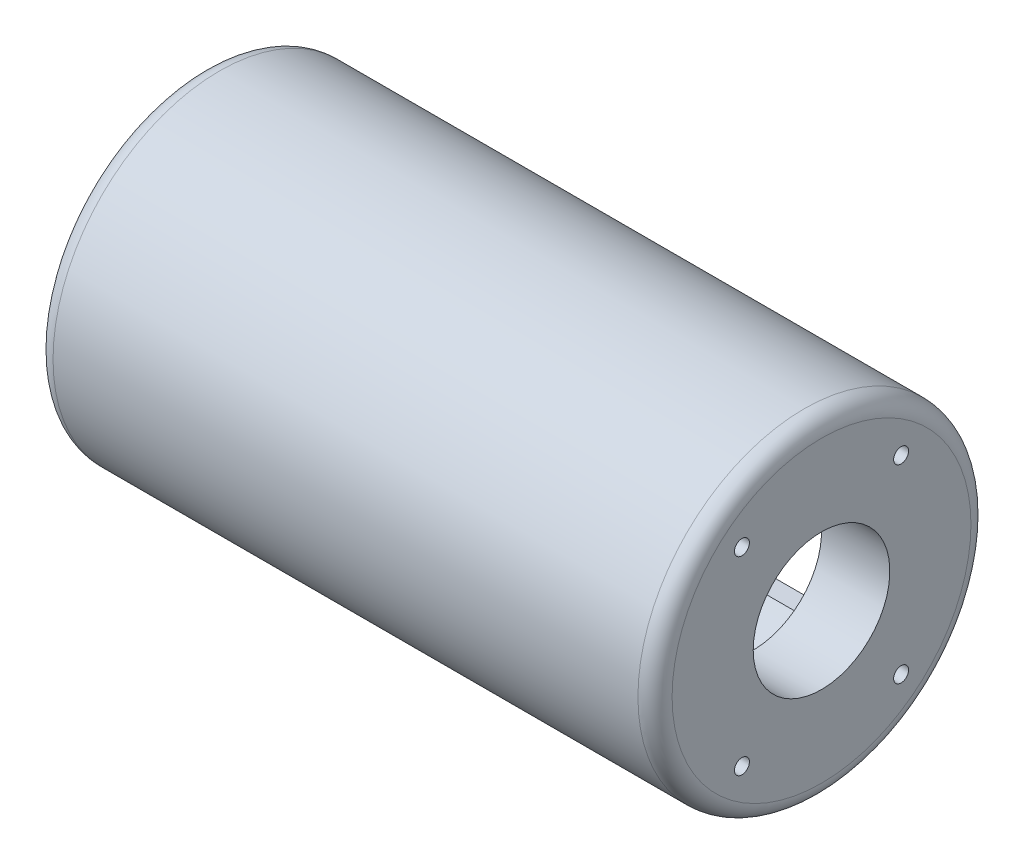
ISO-10303-21;
HEADER;
FILE_DESCRIPTION(('STEP AP214'),'2;1');
FILE_NAME('part.step','',(''),(''),'','','');
FILE_SCHEMA(('AUTOMOTIVE_DESIGN { 1 0 10303 214 1 1 1 1 }'));
ENDSEC;
DATA;
#1=APPLICATION_CONTEXT('core data for automotive mechanical design processes');
#2=APPLICATION_PROTOCOL_DEFINITION('international standard','automotive_design',2000,#1);
#3=PRODUCT_CONTEXT('',#1,'mechanical');
#4=PRODUCT('Part','Part','',(#3));
#5=PRODUCT_RELATED_PRODUCT_CATEGORY('part','',(#4));
#6=PRODUCT_DEFINITION_FORMATION('','',#4);
#7=PRODUCT_DEFINITION_CONTEXT('part definition',#1,'design');
#8=PRODUCT_DEFINITION('design','',#6,#7);
#9=PRODUCT_DEFINITION_SHAPE('','',#8);
#10=(LENGTH_UNIT() NAMED_UNIT(*) SI_UNIT(.MILLI.,.METRE.));
#11=(NAMED_UNIT(*) PLANE_ANGLE_UNIT() SI_UNIT($,.RADIAN.));
#12=(NAMED_UNIT(*) SI_UNIT($,.STERADIAN.) SOLID_ANGLE_UNIT());
#13=UNCERTAINTY_MEASURE_WITH_UNIT(LENGTH_MEASURE(1.E-05),#10,'distance_accuracy_value','');
#14=(GEOMETRIC_REPRESENTATION_CONTEXT(3) GLOBAL_UNCERTAINTY_ASSIGNED_CONTEXT((#13)) GLOBAL_UNIT_ASSIGNED_CONTEXT((#10,
#11,#12)) REPRESENTATION_CONTEXT('',''));
#15=CARTESIAN_POINT('',(0.,0.,0.));
#16=DIRECTION('',(0.,0.,1.));
#17=DIRECTION('',(1.,0.,0.));
#18=AXIS2_PLACEMENT_3D('',#15,#16,#17);
#19=CARTESIAN_POINT('',(0.,0.,0.));
#20=DIRECTION('',(-1.,0.,0.));
#21=DIRECTION('',(0.,0.,1.));
#22=AXIS2_PLACEMENT_3D('',#19,#20,#21);
#23=CYLINDRICAL_SURFACE('',#22,39.);
#24=DIRECTION('',(-1.,0.,0.));
#25=VECTOR('',#24,1.);
#26=CARTESIAN_POINT('',(0.,-27.,-28.1424945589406));
#27=LINE('',#26,#25);
#28=CARTESIAN_POINT('',(20.,-27.,-28.1424945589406));
#29=VERTEX_POINT('',#28);
#30=CARTESIAN_POINT('',(124.872145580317,-27.,-28.1424945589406));
#31=VERTEX_POINT('',#30);
#32=EDGE_CURVE('E117',#29,#31,#27,.F.);
#33=ORIENTED_EDGE('',*,*,#32,.T.);
#34=CARTESIAN_POINT('',(127.872145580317,-24.,-30.7408522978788));
#35=CARTESIAN_POINT('',(127.872146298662,-23.7994032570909,-30.8974580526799));
#36=CARTESIAN_POINT('',(127.852047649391,-23.5970558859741,-31.0522493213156));
#37=CARTESIAN_POINT('',(127.769336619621,-23.1947319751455,-31.3539089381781));
#38=CARTESIAN_POINT('',(127.706696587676,-22.9947570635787,-31.5007720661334));
#39=CARTESIAN_POINT('',(127.553931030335,-22.6447545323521,-31.7529811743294));
#40=CARTESIAN_POINT('',(127.472007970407,-22.4928530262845,-31.8606887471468));
#41=CARTESIAN_POINT('',(127.278971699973,-22.2006275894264,-32.0649930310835));
#42=CARTESIAN_POINT('',(127.167903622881,-22.060286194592,-32.1616065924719));
#43=CARTESIAN_POINT('',(126.936927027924,-21.8182431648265,-32.3261850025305));
#44=CARTESIAN_POINT('',(126.821242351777,-21.7139471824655,-32.3962620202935));
#45=CARTESIAN_POINT('',(126.570511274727,-21.5220190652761,-32.5240831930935));
#46=CARTESIAN_POINT('',(126.435468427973,-21.4343838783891,-32.5818296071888));
#47=CARTESIAN_POINT('',(126.220117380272,-21.3186356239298,-32.6575862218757));
#48=CARTESIAN_POINT('',(126.14589122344,-21.2825619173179,-32.6810973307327));
#49=CARTESIAN_POINT('',(125.99375583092,-21.21632272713,-32.7241379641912));
#50=CARTESIAN_POINT('',(125.915848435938,-21.1861543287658,-32.7436694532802));
#51=CARTESIAN_POINT('',(125.756949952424,-21.1322209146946,-32.7785032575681));
#52=CARTESIAN_POINT('',(125.67595972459,-21.1084541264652,-32.7938067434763));
#53=CARTESIAN_POINT('',(125.511619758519,-21.0677224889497,-32.819988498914));
#54=CARTESIAN_POINT('',(125.428270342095,-21.0507567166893,-32.8308673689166));
#55=CARTESIAN_POINT('',(125.195726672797,-21.0137337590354,-32.8545865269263));
#56=CARTESIAN_POINT('',(125.044738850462,-21.0011659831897,-32.8626085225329));
#57=CARTESIAN_POINT('',(124.742652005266,-20.9989888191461,-32.8639994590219));
#58=CARTESIAN_POINT('',(124.591553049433,-21.0093704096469,-32.8573741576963));
#59=CARTESIAN_POINT('',(124.302255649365,-21.0512062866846,-32.830584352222));
#60=CARTESIAN_POINT('',(124.163807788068,-21.0814525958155,-32.8111958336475));
#61=CARTESIAN_POINT('',(123.894584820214,-21.1602710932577,-32.7604198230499));
#62=CARTESIAN_POINT('',(123.763810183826,-21.2088444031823,-32.7290315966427));
#63=CARTESIAN_POINT('',(123.507986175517,-21.324273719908,-32.6539468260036));
#64=CARTESIAN_POINT('',(123.383346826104,-21.3917576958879,-32.6098256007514));
#65=CARTESIAN_POINT('',(123.147626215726,-21.5412326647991,-32.5112795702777));
#66=CARTESIAN_POINT('',(123.036549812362,-21.6232288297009,-32.4568510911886));
#67=CARTESIAN_POINT('',(122.817600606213,-21.8087258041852,-32.3325419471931));
#68=CARTESIAN_POINT('',(122.711500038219,-21.9136087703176,-32.2616110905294));
#69=CARTESIAN_POINT('',(122.518515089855,-22.134010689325,-32.1107993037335));
#70=CARTESIAN_POINT('',(122.431640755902,-22.2495351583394,-32.0309137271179));
#71=CARTESIAN_POINT('',(122.264496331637,-22.5075218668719,-31.8502759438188));
#72=CARTESIAN_POINT('',(122.187636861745,-22.6512975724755,-31.7482488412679));
#73=CARTESIAN_POINT('',(122.059335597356,-22.9446460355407,-31.536898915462));
#74=CARTESIAN_POINT('',(122.0079082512,-23.0942220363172,-31.427571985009));
#75=CARTESIAN_POINT('',(121.922264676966,-23.4236008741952,-31.1830765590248));
#76=CARTESIAN_POINT('',(121.892957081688,-23.6039009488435,-31.0468548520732));
#77=CARTESIAN_POINT('',(121.866943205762,-23.9635878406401,-30.7700846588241));
#78=CARTESIAN_POINT('',(121.870264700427,-24.1429737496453,-30.6295325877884));
#79=CARTESIAN_POINT('',(121.911210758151,-24.5245481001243,-30.3251514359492));
#80=CARTESIAN_POINT('',(121.954041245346,-24.7259918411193,-30.1610722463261));
#81=CARTESIAN_POINT('',(122.080618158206,-25.117945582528,-29.8354435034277));
#82=CARTESIAN_POINT('',(122.164369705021,-25.3084542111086,-29.6738942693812));
#83=CARTESIAN_POINT('',(122.356077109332,-25.6432605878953,-29.3847567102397));
#84=CARTESIAN_POINT('',(122.457854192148,-25.7900265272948,-29.2559279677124));
#85=CARTESIAN_POINT('',(122.691150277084,-26.0678667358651,-29.008631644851));
#86=CARTESIAN_POINT('',(122.822623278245,-26.1989648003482,-28.8901484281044));
#87=CARTESIAN_POINT('',(123.078190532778,-26.4086448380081,-28.6984015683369));
#88=CARTESIAN_POINT('',(123.195469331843,-26.4920575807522,-28.6213495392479));
#89=CARTESIAN_POINT('',(123.446564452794,-26.6436993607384,-28.4802383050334));
#90=CARTESIAN_POINT('',(123.580357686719,-26.7119492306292,-28.4161612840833));
#91=CARTESIAN_POINT('',(123.837030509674,-26.8185391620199,-28.3155495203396));
#92=CARTESIAN_POINT('',(123.957440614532,-26.8600652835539,-28.2761219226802));
#93=CARTESIAN_POINT('',(124.206130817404,-26.9279676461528,-28.2114653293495));
#94=CARTESIAN_POINT('',(124.33440519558,-26.9543547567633,-28.186226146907));
#95=CARTESIAN_POINT('',(124.596165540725,-26.9902107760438,-28.1518946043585));
#96=CARTESIAN_POINT('',(124.729675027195,-26.9995914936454,-28.142886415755));
#97=CARTESIAN_POINT('',(124.996790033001,-27.000382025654,-28.1421281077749));
#98=CARTESIAN_POINT('',(125.130395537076,-26.9917942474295,-28.1503756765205));
#99=CARTESIAN_POINT('',(125.382343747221,-26.9588024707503,-28.181969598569));
#100=CARTESIAN_POINT('',(125.501037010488,-26.9357599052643,-28.2040159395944));
#101=CARTESIAN_POINT('',(125.73202926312,-26.8766018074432,-28.2603952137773));
#102=CARTESIAN_POINT('',(125.844325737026,-26.8404811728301,-28.2947329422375));
#103=CARTESIAN_POINT('',(126.096965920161,-26.7429485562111,-28.3869784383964));
#104=CARTESIAN_POINT('',(126.234127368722,-26.6771181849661,-28.4489283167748));
#105=CARTESIAN_POINT('',(126.491951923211,-26.5295064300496,-28.5866316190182));
#106=CARTESIAN_POINT('',(126.612582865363,-26.4476946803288,-28.6624113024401));
#107=CARTESIAN_POINT('',(126.873918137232,-26.242516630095,-28.8505708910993));
#108=CARTESIAN_POINT('',(127.008087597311,-26.1143513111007,-28.9667714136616));
#109=CARTESIAN_POINT('',(127.247001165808,-25.8419986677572,-29.2100082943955));
#110=CARTESIAN_POINT('',(127.351705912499,-25.697790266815,-29.3370588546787));
#111=CARTESIAN_POINT('',(127.534577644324,-25.3941233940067,-29.6003348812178));
#112=CARTESIAN_POINT('',(127.612070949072,-25.2343882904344,-29.736704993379));
#113=CARTESIAN_POINT('',(127.737358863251,-24.9062706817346,-30.0120549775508));
#114=CARTESIAN_POINT('',(127.78520221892,-24.737902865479,-30.1510301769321));
#115=CARTESIAN_POINT('',(127.836031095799,-24.4736626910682,-30.3653463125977));
#116=CARTESIAN_POINT('',(127.849523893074,-24.3797730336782,-30.4407824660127));
#117=CARTESIAN_POINT('',(127.867583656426,-24.1907218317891,-30.5912339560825));
#118=CARTESIAN_POINT('',(127.872145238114,-24.0955595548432,-30.6662490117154));
#119=CARTESIAN_POINT('',(127.872145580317,-24.,-30.7408522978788));
#120=B_SPLINE_CURVE_WITH_KNOTS('',3,(#34,#35,#36,#37,#38,#39,#40,#41,#42,#43,#44,#45,#46,#47,
#48,#49,#50,#51,#52,#53,#54,#55,#56,#57,#58,#59,#60,#61,#62,#63,#64,#65,#66,#67,#68,#69,#70,#71,
#72,#73,#74,#75,#76,#77,#78,#79,#80,#81,#82,#83,#84,#85,#86,#87,#88,#89,#90,#91,#92,#93,#94,#95,
#96,#97,#98,#99,#100,#101,#102,#103,#104,#105,#106,#107,#108,#109,#110,#111,#112,#113,#114,#115,
#116,#117,#118,#119),.UNSPECIFIED.,.T.,.F.,(4,2,2,2,2,2,2,2,2,2,2,2,2,2,2,2,2,2,2,2,2,2,2,2,2,2,
2,2,2,2,2,2,2,2,2,2,2,2,2,2,2,2,4),(0.,0.763051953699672,1.52660035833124,2.13454907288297,
2.7415618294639,3.25191806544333,3.76218071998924,4.01930333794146,4.27629872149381,
4.53322287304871,4.79011214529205,5.24268323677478,5.69507645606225,6.12223027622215,
6.54941024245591,6.99292168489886,7.43659150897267,7.93026881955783,8.42420348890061,
8.99901603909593,9.57415477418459,10.2551295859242,10.9366841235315,11.7232395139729,
12.5098933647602,13.1681962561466,13.8254863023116,14.3135459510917,14.8009308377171,
15.1993028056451,15.5973883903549,15.9975325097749,16.3976230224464,16.7647491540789,
17.1320186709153,17.6221334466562,18.1131887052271,18.7664766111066,19.4206331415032,
20.0900004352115,20.7582643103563,21.1215453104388,21.4850452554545),.UNSPECIFIED.);
#121=CARTESIAN_POINT('',(127.872145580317,-24.,-30.7408522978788));
#122=VERTEX_POINT('',#121);
#123=EDGE_CURVE('E110',#31,#122,#120,.T.);
#124=ORIENTED_EDGE('',*,*,#123,.T.);
#125=CARTESIAN_POINT('',(127.872145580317,0.,0.));
#126=DIRECTION('',(1.,0.,0.));
#127=DIRECTION('',(0.,0.,-1.));
#128=AXIS2_PLACEMENT_3D('',#125,#126,#127);
#129=CIRCLE('',#128,39.);
#130=CARTESIAN_POINT('',(127.872145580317,24.,-30.7408522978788));
#131=VERTEX_POINT('',#130);
#132=EDGE_CURVE('E99',#122,#131,#129,.T.);
#133=ORIENTED_EDGE('',*,*,#132,.T.);
#134=CARTESIAN_POINT('',(127.872145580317,24.,-30.7408522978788));
#135=CARTESIAN_POINT('',(127.872147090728,24.200130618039,-30.5846049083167));
#136=CARTESIAN_POINT('',(127.852157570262,24.3987338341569,-30.4263831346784));
#137=CARTESIAN_POINT('',(127.773495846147,24.7885227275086,-30.1096705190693));
#138=CARTESIAN_POINT('',(127.71476390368,24.9796964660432,-29.9511796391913));
#139=CARTESIAN_POINT('',(127.594770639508,25.2645386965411,-29.7106091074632));
#140=CARTESIAN_POINT('',(127.547064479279,25.362657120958,-29.6268727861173));
#141=CARTESIAN_POINT('',(127.440349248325,25.5544760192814,-29.4615825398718));
#142=CARTESIAN_POINT('',(127.381337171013,25.6481753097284,-29.3800292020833));
#143=CARTESIAN_POINT('',(127.187277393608,25.9208860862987,-29.1404442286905));
#144=CARTESIAN_POINT('',(127.034892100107,26.0922768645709,-28.9868374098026));
#145=CARTESIAN_POINT('',(126.75261692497,26.3417937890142,-28.7598050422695));
#146=CARTESIAN_POINT('',(126.637637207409,26.4300096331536,-28.6786827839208));
#147=CARTESIAN_POINT('',(126.39041092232,26.5916375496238,-28.528877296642));
#148=CARTESIAN_POINT('',(126.258193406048,26.665074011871,-28.4601735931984));
#149=CARTESIAN_POINT('',(126.002928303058,26.7816062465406,-28.3504996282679));
#150=CARTESIAN_POINT('',(125.882485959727,26.8277811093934,-28.3067655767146));
#151=CARTESIAN_POINT('',(125.632683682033,26.9049311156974,-28.2334469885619));
#152=CARTESIAN_POINT('',(125.503329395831,26.9359157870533,-28.2038535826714));
#153=CARTESIAN_POINT('',(125.238110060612,26.9806453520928,-28.1610684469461));
#154=CARTESIAN_POINT('',(125.102209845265,26.9942829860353,-28.1479787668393));
#155=CARTESIAN_POINT('',(124.829295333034,27.0027955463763,-28.1398130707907));
#156=CARTESIAN_POINT('',(124.692281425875,26.9976767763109,-28.1447310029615));
#157=CARTESIAN_POINT('',(124.435635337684,26.9705943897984,-28.1706818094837));
#158=CARTESIAN_POINT('',(124.315638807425,26.9503729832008,-28.1900477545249));
#159=CARTESIAN_POINT('',(124.081587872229,26.8964566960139,-28.2414942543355));
#160=CARTESIAN_POINT('',(123.967535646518,26.8627569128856,-28.2735794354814));
#161=CARTESIAN_POINT('',(123.714212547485,26.7717040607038,-28.3598457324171));
#162=CARTESIAN_POINT('',(123.577680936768,26.7102848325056,-28.4177705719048));
#163=CARTESIAN_POINT('',(123.320178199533,26.5715543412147,-28.5475312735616));
#164=CARTESIAN_POINT('',(123.199236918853,26.4942133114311,-28.6193931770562));
#165=CARTESIAN_POINT('',(122.936477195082,26.2995638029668,-28.7985345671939));
#166=CARTESIAN_POINT('',(122.800861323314,26.1774738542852,-28.9096920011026));
#167=CARTESIAN_POINT('',(122.557854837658,25.917246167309,-29.1432161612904));
#168=CARTESIAN_POINT('',(122.450492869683,25.7790923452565,-29.265594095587));
#169=CARTESIAN_POINT('',(122.260973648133,25.4875099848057,-29.5199101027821));
#170=CARTESIAN_POINT('',(122.179463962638,25.3337999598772,-29.6520047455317));
#171=CARTESIAN_POINT('',(122.044672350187,25.0173466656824,-29.9194820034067));
#172=CARTESIAN_POINT('',(121.991388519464,24.8546040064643,-30.0548643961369));
#173=CARTESIAN_POINT('',(121.904617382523,24.4866328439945,-30.3557671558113));
#174=CARTESIAN_POINT('',(121.877946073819,24.2798555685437,-30.521445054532));
#175=CARTESIAN_POINT('',(121.870509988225,23.9667507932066,-30.7670708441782));
#176=CARTESIAN_POINT('',(121.873480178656,23.8617803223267,-30.8485487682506));
#177=CARTESIAN_POINT('',(121.890577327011,23.6515930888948,-31.0099942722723));
#178=CARTESIAN_POINT('',(121.904705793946,23.5463762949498,-31.0899616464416));
#179=CARTESIAN_POINT('',(121.965162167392,23.2275245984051,-31.3297479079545));
#180=CARTESIAN_POINT('',(122.029683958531,23.014470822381,-31.4864850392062));
#181=CARTESIAN_POINT('',(122.164180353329,22.7039828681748,-31.7103405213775));
#182=CARTESIAN_POINT('',(122.215261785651,22.6020529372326,-31.7830491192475));
#183=CARTESIAN_POINT('',(122.330265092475,22.4024754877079,-31.9240338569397));
#184=CARTESIAN_POINT('',(122.394179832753,22.3048256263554,-31.9923124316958));
#185=CARTESIAN_POINT('',(122.558306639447,22.0840621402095,-32.1452590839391));
#186=CARTESIAN_POINT('',(122.663533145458,21.9632017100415,-32.2278838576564));
#187=CARTESIAN_POINT('',(122.896610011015,21.7364604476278,-32.3812449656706));
#188=CARTESIAN_POINT('',(123.024448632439,21.6305718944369,-32.4519874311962));
#189=CARTESIAN_POINT('',(123.232149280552,21.4865116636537,-32.5473993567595));
#190=CARTESIAN_POINT('',(123.304397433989,21.4407837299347,-32.5775294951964));
#191=CARTESIAN_POINT('',(123.45371206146,21.3551102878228,-32.6337536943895));
#192=CARTESIAN_POINT('',(123.530776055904,21.3151618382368,-32.6598498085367));
#193=CARTESIAN_POINT('',(123.689185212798,21.2416994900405,-32.7076769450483));
#194=CARTESIAN_POINT('',(123.770528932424,21.2081834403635,-32.7294094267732));
#195=CARTESIAN_POINT('',(123.936798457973,21.1481671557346,-32.7682207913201));
#196=CARTESIAN_POINT('',(124.021723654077,21.1216657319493,-32.7853004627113));
#197=CARTESIAN_POINT('',(124.25804598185,21.0594488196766,-32.8253239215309));
#198=CARTESIAN_POINT('',(124.41239242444,21.0312924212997,-32.8433414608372));
#199=CARTESIAN_POINT('',(124.724482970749,20.9995329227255,-32.8636575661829));
#200=CARTESIAN_POINT('',(124.882224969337,20.995915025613,-32.8659656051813));
#201=CARTESIAN_POINT('',(125.182164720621,21.0126145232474,-32.8552901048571));
#202=CARTESIAN_POINT('',(125.324527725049,21.0308904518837,-32.8436108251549));
#203=CARTESIAN_POINT('',(125.603626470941,21.0870632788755,-32.8075732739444));
#204=CARTESIAN_POINT('',(125.740362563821,21.1249589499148,-32.7832157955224));
#205=CARTESIAN_POINT('',(126.006288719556,21.2190215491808,-32.7224123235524));
#206=CARTESIAN_POINT('',(126.135377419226,21.275387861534,-32.6858343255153));
#207=CARTESIAN_POINT('',(126.381704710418,21.4037447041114,-32.6019259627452));
#208=CARTESIAN_POINT('',(126.498939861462,21.475739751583,-32.5545924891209));
#209=CARTESIAN_POINT('',(126.73002540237,21.639876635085,-32.4457436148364));
#210=CARTESIAN_POINT('',(126.842557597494,21.7332665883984,-32.3833209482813));
#211=CARTESIAN_POINT('',(127.050146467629,21.931912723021,-32.2491176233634));
#212=CARTESIAN_POINT('',(127.14519503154,22.0371743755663,-32.1773326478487));
#213=CARTESIAN_POINT('',(127.330411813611,22.2729621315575,-32.0146621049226));
#214=CARTESIAN_POINT('',(127.417677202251,22.4049033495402,-31.9225290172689));
#215=CARTESIAN_POINT('',(127.568762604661,22.6762137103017,-31.7303804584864));
#216=CARTESIAN_POINT('',(127.632567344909,22.8155876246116,-31.6303599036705));
#217=CARTESIAN_POINT('',(127.74835996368,23.1278825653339,-31.4029553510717));
#218=CARTESIAN_POINT('',(127.795126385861,23.3017495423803,-31.2742081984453));
#219=CARTESIAN_POINT('',(127.857027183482,23.6507955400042,-31.011091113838));
#220=CARTESIAN_POINT('',(127.87214426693,23.8259752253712,-30.876718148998));
#221=CARTESIAN_POINT('',(127.872145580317,24.,-30.7408522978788));
#222=B_SPLINE_CURVE_WITH_KNOTS('',3,(#134,#135,#136,#137,#138,#139,#140,#141,#142,#143,#144,
#145,#146,#147,#148,#149,#150,#151,#152,#153,#154,#155,#156,#157,#158,#159,#160,#161,#162,#163,
#164,#165,#166,#167,#168,#169,#170,#171,#172,#173,#174,#175,#176,#177,#178,#179,#180,#181,#182,
#183,#184,#185,#186,#187,#188,#189,#190,#191,#192,#193,#194,#195,#196,#197,#198,#199,#200,#201,
#202,#203,#204,#205,#206,#207,#208,#209,#210,#211,#212,#213,#214,#215,#216,#217,#218,#219,#220,
#221),.UNSPECIFIED.,.T.,.F.,(4,2,2,2,2,2,2,2,2,2,2,2,2,2,2,2,2,2,2,2,2,2,2,2,2,2,2,2,2,2,2,2,2,
2,2,2,2,2,2,2,2,2,2,4),(0.,0.7610383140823,1.52325286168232,1.93533459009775,2.3475260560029,
3.16879294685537,3.66549220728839,4.16136493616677,4.56834300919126,4.97506548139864,
5.38429075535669,5.79337851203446,6.16140783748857,6.52957114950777,7.00852474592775,
7.48838203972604,8.12595166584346,8.76416523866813,9.41729169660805,10.0703740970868,
10.8653437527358,11.2636707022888,11.6620515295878,12.4730586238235,12.8781414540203,
13.2829997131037,13.8216910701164,14.3601036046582,14.6317374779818,14.9032326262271,
15.1746368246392,15.4459949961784,15.9169354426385,16.3875918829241,16.8175742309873,
17.2475296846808,17.6822882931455,18.117172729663,18.5923188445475,19.0676848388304,
19.6148126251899,20.1622959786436,20.8237001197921,21.48546553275),.UNSPECIFIED.);
#223=CARTESIAN_POINT('',(124.872145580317,27.,-28.1424945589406));
#224=VERTEX_POINT('',#223);
#225=EDGE_CURVE('E104',#131,#224,#222,.T.);
#226=ORIENTED_EDGE('',*,*,#225,.T.);
#227=DIRECTION('',(-1.,0.,0.));
#228=VECTOR('',#227,1.);
#229=CARTESIAN_POINT('',(0.,27.,-28.1424945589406));
#230=LINE('',#229,#228);
#231=CARTESIAN_POINT('',(20.,27.,-28.1424945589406));
#232=VERTEX_POINT('',#231);
#233=EDGE_CURVE('E221',#224,#232,#230,.T.);
#234=ORIENTED_EDGE('',*,*,#233,.T.);
#235=CARTESIAN_POINT('',(23.,24.,-30.7408522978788));
#236=CARTESIAN_POINT('',(23.0000015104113,24.200130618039,-30.5846049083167));
#237=CARTESIAN_POINT('',(22.9800119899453,24.3987338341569,-30.4263831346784));
#238=CARTESIAN_POINT('',(22.9013502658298,24.7885227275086,-30.1096705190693));
#239=CARTESIAN_POINT('',(22.8426183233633,24.9796964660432,-29.9511796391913));
#240=CARTESIAN_POINT('',(22.7226250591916,25.2645386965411,-29.7106091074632));
#241=CARTESIAN_POINT('',(22.6749188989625,25.362657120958,-29.6268727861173));
#242=CARTESIAN_POINT('',(22.5682036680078,25.5544760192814,-29.4615825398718));
#243=CARTESIAN_POINT('',(22.5091915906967,25.6481753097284,-29.3800292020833));
#244=CARTESIAN_POINT('',(22.3151318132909,25.9208860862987,-29.1404442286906));
#245=CARTESIAN_POINT('',(22.1627465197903,26.0922768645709,-28.9868374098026));
#246=CARTESIAN_POINT('',(21.8804713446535,26.3417937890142,-28.7598050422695));
#247=CARTESIAN_POINT('',(21.7654916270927,26.4300096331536,-28.6786827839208));
#248=CARTESIAN_POINT('',(21.5182653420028,26.5916375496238,-28.528877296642));
#249=CARTESIAN_POINT('',(21.3860478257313,26.665074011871,-28.4601735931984));
#250=CARTESIAN_POINT('',(21.130782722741,26.7816062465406,-28.3504996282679));
#251=CARTESIAN_POINT('',(21.0103403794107,26.8277811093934,-28.3067655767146));
#252=CARTESIAN_POINT('',(20.7605381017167,26.9049311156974,-28.2334469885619));
#253=CARTESIAN_POINT('',(20.6311838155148,26.9359157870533,-28.2038535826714));
#254=CARTESIAN_POINT('',(20.3659644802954,26.9806453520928,-28.1610684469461));
#255=CARTESIAN_POINT('',(20.2300642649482,26.9942829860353,-28.1479787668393));
#256=CARTESIAN_POINT('',(19.9571497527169,27.0027955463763,-28.1398130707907));
#257=CARTESIAN_POINT('',(19.8201358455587,26.9976767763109,-28.1447310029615));
#258=CARTESIAN_POINT('',(19.5634897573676,26.9705943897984,-28.1706818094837));
#259=CARTESIAN_POINT('',(19.443493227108,26.9503729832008,-28.1900477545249));
#260=CARTESIAN_POINT('',(19.2094422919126,26.8964566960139,-28.2414942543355));
#261=CARTESIAN_POINT('',(19.0953900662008,26.8627569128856,-28.2735794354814));
#262=CARTESIAN_POINT('',(18.8420669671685,26.7717040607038,-28.3598457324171));
#263=CARTESIAN_POINT('',(18.7055353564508,26.7102848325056,-28.4177705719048));
#264=CARTESIAN_POINT('',(18.4480326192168,26.5715543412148,-28.5475312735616));
#265=CARTESIAN_POINT('',(18.327091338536,26.4942133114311,-28.6193931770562));
#266=CARTESIAN_POINT('',(18.0643316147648,26.2995638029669,-28.7985345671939));
#267=CARTESIAN_POINT('',(17.9287157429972,26.1774738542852,-28.9096920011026));
#268=CARTESIAN_POINT('',(17.6857092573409,25.917246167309,-29.1432161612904));
#269=CARTESIAN_POINT('',(17.5783472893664,25.7790923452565,-29.265594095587));
#270=CARTESIAN_POINT('',(17.3888280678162,25.4875099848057,-29.5199101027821));
#271=CARTESIAN_POINT('',(17.3073183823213,25.3337999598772,-29.6520047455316));
#272=CARTESIAN_POINT('',(17.1725267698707,25.0173466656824,-29.9194820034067));
#273=CARTESIAN_POINT('',(17.1192429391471,24.8546040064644,-30.0548643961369));
#274=CARTESIAN_POINT('',(17.0324718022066,24.4866328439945,-30.3557671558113));
#275=CARTESIAN_POINT('',(17.0058004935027,24.2798555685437,-30.521445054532));
#276=CARTESIAN_POINT('',(16.9983644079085,23.9667507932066,-30.7670708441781));
#277=CARTESIAN_POINT('',(17.0013345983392,23.8617803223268,-30.8485487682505));
#278=CARTESIAN_POINT('',(17.0184317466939,23.6515930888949,-31.0099942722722));
#279=CARTESIAN_POINT('',(17.0325602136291,23.5463762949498,-31.0899616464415));
#280=CARTESIAN_POINT('',(17.0930165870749,23.2275245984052,-31.3297479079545));
#281=CARTESIAN_POINT('',(17.1575383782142,23.014470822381,-31.4864850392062));
#282=CARTESIAN_POINT('',(17.2920347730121,22.7039828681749,-31.7103405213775));
#283=CARTESIAN_POINT('',(17.3431162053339,22.6020529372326,-31.7830491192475));
#284=CARTESIAN_POINT('',(17.4581195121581,22.402475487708,-31.9240338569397));
#285=CARTESIAN_POINT('',(17.5220342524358,22.3048256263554,-31.9923124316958));
#286=CARTESIAN_POINT('',(17.6861610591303,22.0840621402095,-32.1452590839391));
#287=CARTESIAN_POINT('',(17.7913875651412,21.9632017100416,-32.2278838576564));
#288=CARTESIAN_POINT('',(18.0244644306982,21.7364604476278,-32.3812449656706));
#289=CARTESIAN_POINT('',(18.1523030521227,21.6305718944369,-32.4519874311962));
#290=CARTESIAN_POINT('',(18.3600037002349,21.4865116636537,-32.5473993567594));
#291=CARTESIAN_POINT('',(18.4322518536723,21.4407837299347,-32.5775294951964));
#292=CARTESIAN_POINT('',(18.5815664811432,21.3551102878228,-32.6337536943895));
#293=CARTESIAN_POINT('',(18.6586304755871,21.3151618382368,-32.6598498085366));
#294=CARTESIAN_POINT('',(18.8170396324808,21.2416994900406,-32.7076769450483));
#295=CARTESIAN_POINT('',(18.8983833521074,21.2081834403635,-32.7294094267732));
#296=CARTESIAN_POINT('',(19.0646528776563,21.1481671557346,-32.7682207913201));
#297=CARTESIAN_POINT('',(19.1495780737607,21.1216657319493,-32.7853004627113));
#298=CARTESIAN_POINT('',(19.3859004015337,21.0594488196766,-32.8253239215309));
#299=CARTESIAN_POINT('',(19.5402468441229,21.0312924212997,-32.8433414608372));
#300=CARTESIAN_POINT('',(19.8523373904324,20.9995329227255,-32.8636575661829));
#301=CARTESIAN_POINT('',(20.0100793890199,20.995915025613,-32.8659656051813));
#302=CARTESIAN_POINT('',(20.3100191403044,21.0126145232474,-32.8552901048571));
#303=CARTESIAN_POINT('',(20.452382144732,21.0308904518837,-32.8436108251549));
#304=CARTESIAN_POINT('',(20.7314808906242,21.0870632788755,-32.8075732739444));
#305=CARTESIAN_POINT('',(20.8682169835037,21.1249589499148,-32.7832157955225));
#306=CARTESIAN_POINT('',(21.1341431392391,21.2190215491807,-32.7224123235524));
#307=CARTESIAN_POINT('',(21.263231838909,21.2753878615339,-32.6858343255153));
#308=CARTESIAN_POINT('',(21.5095591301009,21.4037447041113,-32.6019259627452));
#309=CARTESIAN_POINT('',(21.6267942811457,21.475739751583,-32.5545924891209));
#310=CARTESIAN_POINT('',(21.857879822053,21.639876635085,-32.4457436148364));
#311=CARTESIAN_POINT('',(21.9704120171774,21.7332665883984,-32.3833209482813));
#312=CARTESIAN_POINT('',(22.178000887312,21.931912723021,-32.2491176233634));
#313=CARTESIAN_POINT('',(22.2730494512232,22.0371743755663,-32.1773326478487));
#314=CARTESIAN_POINT('',(22.4582662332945,22.2729621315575,-32.0146621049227));
#315=CARTESIAN_POINT('',(22.5455316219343,22.4049033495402,-31.9225290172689));
#316=CARTESIAN_POINT('',(22.6966170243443,22.6762137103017,-31.7303804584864));
#317=CARTESIAN_POINT('',(22.7604217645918,22.8155876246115,-31.6303599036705));
#318=CARTESIAN_POINT('',(22.8762143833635,23.1278825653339,-31.4029553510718));
#319=CARTESIAN_POINT('',(22.9229808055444,23.3017495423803,-31.2742081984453));
#320=CARTESIAN_POINT('',(22.9848816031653,23.6507955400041,-31.011091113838));
#321=CARTESIAN_POINT('',(22.9999986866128,23.8259752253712,-30.876718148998));
#322=CARTESIAN_POINT('',(23.,24.,-30.7408522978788));
#323=B_SPLINE_CURVE_WITH_KNOTS('',3,(#235,#236,#237,#238,#239,#240,#241,#242,#243,#244,#245,
#246,#247,#248,#249,#250,#251,#252,#253,#254,#255,#256,#257,#258,#259,#260,#261,#262,#263,#264,
#265,#266,#267,#268,#269,#270,#271,#272,#273,#274,#275,#276,#277,#278,#279,#280,#281,#282,#283,
#284,#285,#286,#287,#288,#289,#290,#291,#292,#293,#294,#295,#296,#297,#298,#299,#300,#301,#302,
#303,#304,#305,#306,#307,#308,#309,#310,#311,#312,#313,#314,#315,#316,#317,#318,#319,#320,#321,
#322),.UNSPECIFIED.,.T.,.F.,(4,2,2,2,2,2,2,2,2,2,2,2,2,2,2,2,2,2,2,2,2,2,2,2,2,2,2,2,2,2,2,2,2,
2,2,2,2,2,2,2,2,2,2,4),(0.,0.761038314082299,1.52325286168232,1.93533459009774,2.34752605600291,
3.16879294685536,3.66549220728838,4.16136493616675,4.56834300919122,4.9750654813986,
5.38429075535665,5.79337851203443,6.16140783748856,6.52957114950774,7.00852474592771,
7.48838203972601,8.12595166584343,8.76416523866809,9.417291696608,10.0703740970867,
10.8653437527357,11.2636707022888,11.6620515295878,12.4730586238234,12.8781414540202,
13.2829997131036,13.8216910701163,14.3601036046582,14.6317374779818,14.9032326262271,
15.1746368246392,15.4459949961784,15.9169354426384,16.387591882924,16.8175742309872,
17.2475296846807,17.6822882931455,18.117172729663,18.5923188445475,19.0676848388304,
19.6148126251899,20.1622959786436,20.8237001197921,21.48546553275),.UNSPECIFIED.);
#324=CARTESIAN_POINT('',(17.,24.,-30.7408522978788));
#325=VERTEX_POINT('',#324);
#326=EDGE_CURVE('E216',#232,#325,#323,.T.);
#327=ORIENTED_EDGE('',*,*,#326,.T.);
#328=CARTESIAN_POINT('',(17.,0.,0.));
#329=DIRECTION('',(-1.,0.,0.));
#330=DIRECTION('',(0.,-1.,0.));
#331=AXIS2_PLACEMENT_3D('',#328,#329,#330);
#332=CIRCLE('',#331,39.);
#333=CARTESIAN_POINT('',(17.,-24.,-30.7408522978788));
#334=VERTEX_POINT('',#333);
#335=EDGE_CURVE('E213',#325,#334,#332,.T.);
#336=ORIENTED_EDGE('',*,*,#335,.T.);
#337=CARTESIAN_POINT('',(17.,-24.,-30.7408522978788));
#338=CARTESIAN_POINT('',(17.0000109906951,-24.099686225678,-30.6630316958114));
#339=CARTESIAN_POINT('',(17.0049688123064,-24.1989787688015,-30.5847253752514));
#340=CARTESIAN_POINT('',(17.0246253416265,-24.3962136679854,-30.4276280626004));
#341=CARTESIAN_POINT('',(17.0393243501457,-24.494155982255,-30.3488370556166));
#342=CARTESIAN_POINT('',(17.0784967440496,-24.6890481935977,-30.1905090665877));
#343=CARTESIAN_POINT('',(17.1030621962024,-24.7859796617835,-30.1109721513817));
#344=CARTESIAN_POINT('',(17.1618889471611,-24.9773168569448,-29.9524469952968));
#345=CARTESIAN_POINT('',(17.1961506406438,-25.0717224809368,-29.8734587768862));
#346=CARTESIAN_POINT('',(17.277394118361,-25.2645890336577,-29.71056446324));
#347=CARTESIAN_POINT('',(17.3251519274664,-25.3628028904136,-29.6267477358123));
#348=CARTESIAN_POINT('',(17.4319746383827,-25.5547779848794,-29.4613217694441));
#349=CARTESIAN_POINT('',(17.4910423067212,-25.6485381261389,-29.3797130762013));
#350=CARTESIAN_POINT('',(17.6851012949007,-25.9211456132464,-29.1402110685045));
#351=CARTESIAN_POINT('',(17.8373896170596,-26.0923957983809,-28.9867290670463));
#352=CARTESIAN_POINT('',(18.119509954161,-26.3417781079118,-28.7598193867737));
#353=CARTESIAN_POINT('',(18.2344669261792,-26.4299792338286,-28.6787107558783));
#354=CARTESIAN_POINT('',(18.4816908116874,-26.5916121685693,-28.5289010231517));
#355=CARTESIAN_POINT('',(18.6139346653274,-26.6650633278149,-28.460183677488));
#356=CARTESIAN_POINT('',(18.8692969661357,-26.781644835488,-28.3504632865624));
#357=CARTESIAN_POINT('',(18.9898191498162,-26.8278483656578,-28.3067017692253));
#358=CARTESIAN_POINT('',(19.2396732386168,-26.9049784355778,-28.2334019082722));
#359=CARTESIAN_POINT('',(19.3689860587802,-26.935936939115,-28.203833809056));
#360=CARTESIAN_POINT('',(19.5826787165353,-26.9719886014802,-28.1693485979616));
#361=CARTESIAN_POINT('',(19.6653788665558,-26.9824436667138,-28.1593304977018));
#362=CARTESIAN_POINT('',(19.8320291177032,-26.9964693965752,-28.1458819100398));
#363=CARTESIAN_POINT('',(19.9159811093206,-27.0000282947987,-28.1424626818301));
#364=CARTESIAN_POINT('',(20.,-27.,-28.1424945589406));
#365=B_SPLINE_CURVE_WITH_KNOTS('',3,(#337,#338,#339,#340,#341,#342,#343,#344,#345,#346,#347,
#348,#349,#350,#351,#352,#353,#354,#355,#356,#357,#358,#359,#360,#361,#362,#363,#364),
.UNSPECIFIED.,.F.,.F.,(4,2,2,2,2,2,2,2,2,2,2,2,2,4),(0.,0.379280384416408,0.758572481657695,
1.14148929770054,1.52442170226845,1.93682526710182,2.34932983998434,3.16996430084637,
3.66657818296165,4.16253624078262,4.56981538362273,4.97623692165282,5.22760000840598,
5.47939160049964),.UNSPECIFIED.);
#366=EDGE_CURVE('E123',#334,#29,#365,.T.);
#367=ORIENTED_EDGE('',*,*,#366,.T.);
#368=EDGE_LOOP('',(#33,#124,#133,#226,#234,#327,#336,#367));
#369=FACE_BOUND('',#368,.T.);
#370=CARTESIAN_POINT('',(4.,0.,0.));
#371=DIRECTION('',(1.,0.,0.));
#372=DIRECTION('',(0.,0.,-1.));
#373=AXIS2_PLACEMENT_3D('',#370,#371,#372);
#374=CIRCLE('',#373,39.);
#375=CARTESIAN_POINT('',(4.,0.,-39.));
#376=VERTEX_POINT('',#375);
#377=EDGE_CURVE('E265',#376,#376,#374,.T.);
#378=ORIENTED_EDGE('',*,*,#377,.T.);
#379=EDGE_LOOP('',(#378));
#380=FACE_BOUND('',#379,.T.);
#381=CARTESIAN_POINT('',(141.,0.,0.));
#382=DIRECTION('',(-1.,0.,0.));
#383=DIRECTION('',(0.,0.,1.));
#384=AXIS2_PLACEMENT_3D('',#381,#382,#383);
#385=CIRCLE('',#384,39.);
#386=CARTESIAN_POINT('',(141.,0.,39.));
#387=VERTEX_POINT('',#386);
#388=EDGE_CURVE('E285',#387,#387,#385,.T.);
#389=ORIENTED_EDGE('',*,*,#388,.T.);
#390=EDGE_LOOP('',(#389));
#391=FACE_BOUND('',#390,.T.);
#392=ADVANCED_FACE('F33',(#369,#380,#391),#23,.T.);
#393=CARTESIAN_POINT('',(145.,39.,0.));
#394=DIRECTION('',(-1.,0.,0.));
#395=DIRECTION('',(0.,0.,1.));
#396=AXIS2_PLACEMENT_3D('',#393,#394,#395);
#397=PLANE('',#396);
#398=CARTESIAN_POINT('',(145.,-22.2152888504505,18.6408406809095));
#399=DIRECTION('',(1.,0.,0.));
#400=DIRECTION('',(0.,0.,-1.));
#401=AXIS2_PLACEMENT_3D('',#398,#399,#400);
#402=CIRCLE('',#401,1.75);
#403=CARTESIAN_POINT('',(145.,-22.2152888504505,16.8908406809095));
#404=VERTEX_POINT('',#403);
#405=EDGE_CURVE('E118',#404,#404,#402,.T.);
#406=ORIENTED_EDGE('',*,*,#405,.F.);
#407=EDGE_LOOP('',(#406));
#408=FACE_BOUND('',#407,.T.);
#409=CARTESIAN_POINT('',(145.,-22.2152888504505,-18.6408406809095));
#410=DIRECTION('',(1.,0.,0.));
#411=DIRECTION('',(0.,0.,1.));
#412=AXIS2_PLACEMENT_3D('',#409,#410,#411);
#413=CIRCLE('',#412,1.75);
#414=CARTESIAN_POINT('',(145.,-22.2152888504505,-16.8908406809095));
#415=VERTEX_POINT('',#414);
#416=EDGE_CURVE('E270',#415,#415,#413,.T.);
#417=ORIENTED_EDGE('',*,*,#416,.F.);
#418=EDGE_LOOP('',(#417));
#419=FACE_BOUND('',#418,.T.);
#420=CARTESIAN_POINT('',(145.,22.2152888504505,18.6408406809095));
#421=DIRECTION('',(1.,0.,0.));
#422=DIRECTION('',(0.,0.,1.));
#423=AXIS2_PLACEMENT_3D('',#420,#421,#422);
#424=CIRCLE('',#423,1.75);
#425=CARTESIAN_POINT('',(145.,22.2152888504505,20.3908406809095));
#426=VERTEX_POINT('',#425);
#427=EDGE_CURVE('E274',#426,#426,#424,.T.);
#428=ORIENTED_EDGE('',*,*,#427,.F.);
#429=EDGE_LOOP('',(#428));
#430=FACE_BOUND('',#429,.T.);
#431=CARTESIAN_POINT('',(145.,22.2152888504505,-18.6408406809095));
#432=DIRECTION('',(1.,0.,0.));
#433=DIRECTION('',(0.,0.,-1.));
#434=AXIS2_PLACEMENT_3D('',#431,#432,#433);
#435=CIRCLE('',#434,1.75);
#436=CARTESIAN_POINT('',(145.,22.2152888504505,-20.3908406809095));
#437=VERTEX_POINT('',#436);
#438=EDGE_CURVE('E278',#437,#437,#435,.T.);
#439=ORIENTED_EDGE('',*,*,#438,.F.);
#440=EDGE_LOOP('',(#439));
#441=FACE_BOUND('',#440,.T.);
#442=CARTESIAN_POINT('',(145.,0.,0.));
#443=DIRECTION('',(-1.,0.,0.));
#444=DIRECTION('',(0.,0.,1.));
#445=AXIS2_PLACEMENT_3D('',#442,#443,#444);
#446=CIRCLE('',#445,35.);
#447=CARTESIAN_POINT('',(145.,0.,35.));
#448=VERTEX_POINT('',#447);
#449=EDGE_CURVE('E262',#448,#448,#446,.F.);
#450=ORIENTED_EDGE('',*,*,#449,.T.);
#451=EDGE_LOOP('',(#450));
#452=FACE_BOUND('',#451,.T.);
#453=CARTESIAN_POINT('',(145.,0.,0.));
#454=DIRECTION('',(-1.,0.,0.));
#455=DIRECTION('',(0.,0.,1.));
#456=AXIS2_PLACEMENT_3D('',#453,#454,#455);
#457=CIRCLE('',#456,16.);
#458=CARTESIAN_POINT('',(145.,0.,16.));
#459=VERTEX_POINT('',#458);
#460=EDGE_CURVE('E291',#459,#459,#457,.T.);
#461=ORIENTED_EDGE('',*,*,#460,.T.);
#462=EDGE_LOOP('',(#461));
#463=FACE_BOUND('',#462,.T.);
#464=ADVANCED_FACE('F315',(#408,#419,#430,#441,#452,#463),#397,.F.);
#465=CARTESIAN_POINT('',(0.,0.,0.));
#466=DIRECTION('',(-1.,0.,0.));
#467=DIRECTION('',(0.,0.,1.));
#468=AXIS2_PLACEMENT_3D('',#465,#466,#467);
#469=CYLINDRICAL_SURFACE('',#468,16.);
#470=ORIENTED_EDGE('',*,*,#460,.F.);
#471=EDGE_LOOP('',(#470));
#472=FACE_BOUND('',#471,.T.);
#473=CARTESIAN_POINT('',(129.,0.,0.));
#474=DIRECTION('',(-1.,0.,0.));
#475=DIRECTION('',(0.,0.,1.));
#476=AXIS2_PLACEMENT_3D('',#473,#474,#475);
#477=CIRCLE('',#476,16.);
#478=CARTESIAN_POINT('',(129.,0.,16.));
#479=VERTEX_POINT('',#478);
#480=EDGE_CURVE('E294',#479,#479,#477,.T.);
#481=ORIENTED_EDGE('',*,*,#480,.T.);
#482=EDGE_LOOP('',(#481));
#483=FACE_BOUND('',#482,.T.);
#484=ADVANCED_FACE('F318',(#472,#483),#469,.F.);
#485=CARTESIAN_POINT('',(129.,36.,0.));
#486=DIRECTION('',(1.,0.,0.));
#487=DIRECTION('',(0.,0.,-1.));
#488=AXIS2_PLACEMENT_3D('',#485,#486,#487);
#489=PLANE('',#488);
#490=CARTESIAN_POINT('',(129.,-22.2152888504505,18.6408406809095));
#491=DIRECTION('',(1.,0.,0.));
#492=DIRECTION('',(0.,0.,-1.));
#493=AXIS2_PLACEMENT_3D('',#490,#491,#492);
#494=CIRCLE('',#493,1.75);
#495=CARTESIAN_POINT('',(129.,-22.2152888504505,16.8908406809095));
#496=VERTEX_POINT('',#495);
#497=EDGE_CURVE('E121',#496,#496,#494,.T.);
#498=ORIENTED_EDGE('',*,*,#497,.T.);
#499=EDGE_LOOP('',(#498));
#500=FACE_BOUND('',#499,.T.);
#501=CARTESIAN_POINT('',(129.,-22.2152888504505,-18.6408406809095));
#502=DIRECTION('',(1.,0.,0.));
#503=DIRECTION('',(0.,0.,-1.));
#504=AXIS2_PLACEMENT_3D('',#501,#502,#503);
#505=CIRCLE('',#504,1.75);
#506=CARTESIAN_POINT('',(129.,-22.2152888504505,-20.3908406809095));
#507=VERTEX_POINT('',#506);
#508=EDGE_CURVE('E271',#507,#507,#505,.T.);
#509=ORIENTED_EDGE('',*,*,#508,.T.);
#510=EDGE_LOOP('',(#509));
#511=FACE_BOUND('',#510,.T.);
#512=CARTESIAN_POINT('',(129.,22.2152888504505,18.6408406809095));
#513=DIRECTION('',(1.,0.,0.));
#514=DIRECTION('',(0.,0.,-1.));
#515=AXIS2_PLACEMENT_3D('',#512,#513,#514);
#516=CIRCLE('',#515,1.75);
#517=CARTESIAN_POINT('',(129.,22.2152888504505,16.8908406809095));
#518=VERTEX_POINT('',#517);
#519=EDGE_CURVE('E275',#518,#518,#516,.T.);
#520=ORIENTED_EDGE('',*,*,#519,.T.);
#521=EDGE_LOOP('',(#520));
#522=FACE_BOUND('',#521,.T.);
#523=CARTESIAN_POINT('',(129.,22.2152888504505,-18.6408406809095));
#524=DIRECTION('',(1.,0.,0.));
#525=DIRECTION('',(0.,0.,-1.));
#526=AXIS2_PLACEMENT_3D('',#523,#524,#525);
#527=CIRCLE('',#526,1.75);
#528=CARTESIAN_POINT('',(129.,22.2152888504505,-20.3908406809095));
#529=VERTEX_POINT('',#528);
#530=EDGE_CURVE('E279',#529,#529,#527,.T.);
#531=ORIENTED_EDGE('',*,*,#530,.T.);
#532=EDGE_LOOP('',(#531));
#533=FACE_BOUND('',#532,.T.);
#534=ORIENTED_EDGE('',*,*,#480,.F.);
#535=EDGE_LOOP('',(#534));
#536=FACE_BOUND('',#535,.T.);
#537=CARTESIAN_POINT('',(129.,0.,0.));
#538=DIRECTION('',(-1.,0.,0.));
#539=DIRECTION('',(0.,0.,1.));
#540=AXIS2_PLACEMENT_3D('',#537,#538,#539);
#541=CIRCLE('',#540,36.);
#542=CARTESIAN_POINT('',(129.,0.,36.));
#543=VERTEX_POINT('',#542);
#544=EDGE_CURVE('E297',#543,#543,#541,.T.);
#545=ORIENTED_EDGE('',*,*,#544,.T.);
#546=EDGE_LOOP('',(#545));
#547=FACE_BOUND('',#546,.T.);
#548=ADVANCED_FACE('F175',(#500,#511,#522,#533,#536,#547),#489,.F.);
#549=CARTESIAN_POINT('',(0.,0.,0.));
#550=DIRECTION('',(-1.,0.,0.));
#551=DIRECTION('',(0.,0.,1.));
#552=AXIS2_PLACEMENT_3D('',#549,#550,#551);
#553=CYLINDRICAL_SURFACE('',#552,36.);
#554=CARTESIAN_POINT('',(127.872145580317,0.,0.));
#555=DIRECTION('',(1.,0.,0.));
#556=DIRECTION('',(0.,0.,-1.));
#557=AXIS2_PLACEMENT_3D('',#554,#555,#556);
#558=CIRCLE('',#557,36.);
#559=CARTESIAN_POINT('',(127.872145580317,24.,-26.8328157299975));
#560=VERTEX_POINT('',#559);
#561=CARTESIAN_POINT('',(127.872145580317,-24.,-26.8328157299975));
#562=VERTEX_POINT('',#561);
#563=EDGE_CURVE('E260',#560,#562,#558,.F.);
#564=ORIENTED_EDGE('',*,*,#563,.T.);
#565=CARTESIAN_POINT('',(127.872145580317,-24.,-26.8328157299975));
#566=CARTESIAN_POINT('',(127.872148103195,-24.1883077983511,-26.6643825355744));
#567=CARTESIAN_POINT('',(127.854443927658,-24.3749667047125,-26.4938419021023));
#568=CARTESIAN_POINT('',(127.784980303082,-24.741906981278,-26.151506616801));
#569=CARTESIAN_POINT('',(127.733092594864,-24.9221616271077,-25.9797096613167));
#570=CARTESIAN_POINT('',(127.622349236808,-25.2039600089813,-25.705693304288));
#571=CARTESIAN_POINT('',(127.574103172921,-25.3087843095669,-25.6024689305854));
#572=CARTESIAN_POINT('',(127.464781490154,-25.5138526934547,-25.3981150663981));
#573=CARTESIAN_POINT('',(127.403700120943,-25.6140946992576,-25.2969865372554));
#574=CARTESIAN_POINT('',(127.268536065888,-25.8086758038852,-25.0984366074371));
#575=CARTESIAN_POINT('',(127.1944911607,-25.9030310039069,-25.0010054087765));
#576=CARTESIAN_POINT('',(127.032774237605,-26.0848182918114,-24.8112774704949));
#577=CARTESIAN_POINT('',(126.945115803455,-26.1722571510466,-24.7189757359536));
#578=CARTESIAN_POINT('',(126.749840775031,-26.3435261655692,-24.536405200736));
#579=CARTESIAN_POINT('',(126.641354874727,-26.4268434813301,-24.446573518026));
#580=CARTESIAN_POINT('',(126.407639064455,-26.5810442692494,-24.2788185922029));
#581=CARTESIAN_POINT('',(126.282436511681,-26.6519476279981,-24.2008763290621));
#582=CARTESIAN_POINT('',(126.04135451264,-26.7653389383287,-24.075347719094));
#583=CARTESIAN_POINT('',(125.928369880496,-26.8106707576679,-24.024805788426));
#584=CARTESIAN_POINT('',(125.692664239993,-26.8882621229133,-23.9379360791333));
#585=CARTESIAN_POINT('',(125.569950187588,-26.9205309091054,-23.9015982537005));
#586=CARTESIAN_POINT('',(125.380241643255,-26.9573758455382,-23.8600130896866));
#587=CARTESIAN_POINT('',(125.315716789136,-26.9677543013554,-23.84827836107));
#588=CARTESIAN_POINT('',(125.185464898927,-26.9843139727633,-23.8295396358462));
#589=CARTESIAN_POINT('',(125.119738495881,-26.9904973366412,-23.8225332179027));
#590=CARTESIAN_POINT('',(124.987703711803,-26.9985026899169,-23.8134602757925));
#591=CARTESIAN_POINT('',(124.921395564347,-27.0003263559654,-23.8113918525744));
#592=CARTESIAN_POINT('',(124.788858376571,-26.9995770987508,-23.8122412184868));
#593=CARTESIAN_POINT('',(124.722629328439,-26.9970046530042,-23.8151584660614));
#594=CARTESIAN_POINT('',(124.543804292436,-26.984118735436,-23.8297612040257));
#595=CARTESIAN_POINT('',(124.431846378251,-26.9695912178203,-23.8462181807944));
#596=CARTESIAN_POINT('',(124.212980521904,-26.9288135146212,-23.8922565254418));
#597=CARTESIAN_POINT('',(124.10607486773,-26.9025580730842,-23.9218437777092));
#598=CARTESIAN_POINT('',(123.866672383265,-26.8300478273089,-24.0031733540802));
#599=CARTESIAN_POINT('',(123.736667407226,-26.7801030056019,-24.0589540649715));
#600=CARTESIAN_POINT('',(123.490479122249,-26.6663622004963,-24.1849611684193));
#601=CARTESIAN_POINT('',(123.374323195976,-26.602539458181,-24.2552154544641));
#602=CARTESIAN_POINT('',(123.111087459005,-26.4355701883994,-24.4372955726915));
#603=CARTESIAN_POINT('',(122.971030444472,-26.3270653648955,-24.5543118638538));
#604=CARTESIAN_POINT('',(122.717583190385,-26.0946401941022,-24.801182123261));
#605=CARTESIAN_POINT('',(122.604243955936,-25.9706910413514,-24.9310599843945));
#606=CARTESIAN_POINT('',(122.434734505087,-25.7525842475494,-25.1559264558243));
#607=CARTESIAN_POINT('',(122.371837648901,-25.6614600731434,-25.2489024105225));
#608=CARTESIAN_POINT('',(122.257329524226,-25.4747010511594,-25.4373188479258));
#609=CARTESIAN_POINT('',(122.205722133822,-25.3790646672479,-25.5327601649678));
#610=CARTESIAN_POINT('',(122.113554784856,-25.1839843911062,-25.7251959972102));
#611=CARTESIAN_POINT('',(122.073001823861,-25.0845381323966,-25.8221914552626));
#612=CARTESIAN_POINT('',(122.002912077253,-24.8825661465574,-26.0168719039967));
#613=CARTESIAN_POINT('',(121.97337407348,-24.780040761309,-26.1145568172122));
#614=CARTESIAN_POINT('',(121.900638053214,-24.4656930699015,-26.4104737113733));
#615=CARTESIAN_POINT('',(121.874585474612,-24.2498017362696,-26.6088945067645));
#616=CARTESIAN_POINT('',(121.870034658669,-23.8130287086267,-27.0004734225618));
#617=CARTESIAN_POINT('',(121.891492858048,-23.5921517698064,-27.1936361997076));
#618=CARTESIAN_POINT('',(121.976904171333,-23.1930946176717,-27.5342684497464));
#619=CARTESIAN_POINT('',(122.032203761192,-23.0146198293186,-27.683550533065));
#620=CARTESIAN_POINT('',(122.179338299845,-22.6640254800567,-27.9712907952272));
#621=CARTESIAN_POINT('',(122.2711289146,-22.4918984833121,-28.1097618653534));
#622=CARTESIAN_POINT('',(122.470331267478,-22.1954928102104,-28.3441031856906));
#623=CARTESIAN_POINT('',(122.570574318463,-22.068685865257,-28.4428579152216));
#624=CARTESIAN_POINT('',(122.795797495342,-21.8284099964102,-28.6276684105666));
#625=CARTESIAN_POINT('',(122.920749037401,-21.714925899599,-28.7137386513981));
#626=CARTESIAN_POINT('',(123.171755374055,-21.5242696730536,-28.8568475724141));
#627=CARTESIAN_POINT('',(123.294202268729,-21.4441963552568,-28.9163335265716));
#628=CARTESIAN_POINT('',(123.55399006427,-21.3010332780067,-29.021955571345));
#629=CARTESIAN_POINT('',(123.691325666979,-21.237937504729,-29.0680963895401));
#630=CARTESIAN_POINT('',(123.978693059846,-21.1320185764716,-29.1451909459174));
#631=CARTESIAN_POINT('',(124.128795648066,-21.0893185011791,-29.176052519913));
#632=CARTESIAN_POINT('',(124.436279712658,-21.0277017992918,-29.2204936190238));
#633=CARTESIAN_POINT('',(124.593657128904,-21.0087720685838,-29.2340826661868));
#634=CARTESIAN_POINT('',(124.893040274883,-20.9967370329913,-29.2427265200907));
#635=CARTESIAN_POINT('',(125.0348991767,-21.001097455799,-29.2396001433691));
#636=CARTESIAN_POINT('',(125.3155331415,-21.0295983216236,-29.2191084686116));
#637=CARTESIAN_POINT('',(125.454308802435,-21.0537348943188,-29.2017459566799));
#638=CARTESIAN_POINT('',(125.721781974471,-21.1196057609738,-29.1541392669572));
#639=CARTESIAN_POINT('',(125.850637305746,-21.1609253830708,-29.1241984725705));
#640=CARTESIAN_POINT('',(126.098847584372,-21.2590100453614,-29.0526790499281));
#641=CARTESIAN_POINT('',(126.218200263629,-21.315778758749,-29.0110976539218));
#642=CARTESIAN_POINT('',(126.454619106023,-21.4474441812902,-28.9139124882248));
#643=CARTESIAN_POINT('',(126.57071514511,-21.523437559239,-28.8574451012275));
#644=CARTESIAN_POINT('',(126.788025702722,-21.6874337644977,-28.7343998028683));
#645=CARTESIAN_POINT('',(126.889235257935,-21.7754405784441,-28.6678185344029));
#646=CARTESIAN_POINT('',(127.091004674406,-21.975186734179,-28.5150716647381));
#647=CARTESIAN_POINT('',(127.188936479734,-22.0884789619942,-28.4274738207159));
#648=CARTESIAN_POINT('',(127.364274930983,-22.3234454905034,-28.2433384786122));
#649=CARTESIAN_POINT('',(127.4416554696,-22.4451302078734,-28.1467898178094));
#650=CARTESIAN_POINT('',(127.609284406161,-22.7541205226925,-27.8981346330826));
#651=CARTESIAN_POINT('',(127.687525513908,-22.9445898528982,-27.7418216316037));
#652=CARTESIAN_POINT('',(127.803039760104,-23.3290458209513,-27.4193117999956));
#653=CARTESIAN_POINT('',(127.840326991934,-23.5230312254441,-27.2531183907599));
#654=CARTESIAN_POINT('',(127.867702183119,-23.8109769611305,-27.0009902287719));
#655=CARTESIAN_POINT('',(127.872144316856,-23.9056952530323,-26.9171672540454));
#656=CARTESIAN_POINT('',(127.872145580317,-24.,-26.8328157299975));
#657=B_SPLINE_CURVE_WITH_KNOTS('',3,(#565,#566,#567,#568,#569,#570,#571,#572,#573,#574,#575,
#576,#577,#578,#579,#580,#581,#582,#583,#584,#585,#586,#587,#588,#589,#590,#591,#592,#593,#594,
#595,#596,#597,#598,#599,#600,#601,#602,#603,#604,#605,#606,#607,#608,#609,#610,#611,#612,#613,
#614,#615,#616,#617,#618,#619,#620,#621,#622,#623,#624,#625,#626,#627,#628,#629,#630,#631,#632,
#633,#634,#635,#636,#637,#638,#639,#640,#641,#642,#643,#644,#645,#646,#647,#648,#649,#650,#651,
#652,#653,#654,#655,#656),.UNSPECIFIED.,.T.,.F.,(4,2,2,2,2,2,2,2,2,2,2,2,2,2,2,2,2,2,2,2,2,2,2,
2,2,2,2,2,2,2,2,2,2,2,2,2,2,2,2,2,2,2,2,2,2,4),(0.,0.757709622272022,1.51827854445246,
1.98222609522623,2.4463819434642,2.90920692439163,3.37157302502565,3.861070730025,
4.34977696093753,4.74378165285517,5.13750715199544,5.33644149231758,5.53527388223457,
5.73402979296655,5.93276411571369,6.27331540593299,6.61401947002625,7.06159802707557,
7.51004736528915,8.1435804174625,8.77831328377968,9.21155191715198,9.64493914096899,
10.0786000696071,10.5122130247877,11.3913279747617,12.269637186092,12.9844573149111,
13.6984116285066,14.2645510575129,14.8300393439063,15.3019012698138,15.7735958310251,
16.2481019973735,16.7223464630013,17.1461126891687,17.5697960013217,17.983799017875,
18.3979005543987,18.8455796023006,19.2934075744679,19.8119760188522,20.3312001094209,
21.1026346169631,21.8738035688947,22.2532653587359),.UNSPECIFIED.);
#658=CARTESIAN_POINT('',(124.872145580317,-27.,-23.8117617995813));
#659=VERTEX_POINT('',#658);
#660=EDGE_CURVE('E11',#562,#659,#657,.T.);
#661=ORIENTED_EDGE('',*,*,#660,.T.);
#662=DIRECTION('',(-1.,0.,0.));
#663=VECTOR('',#662,1.);
#664=CARTESIAN_POINT('',(0.,-27.,-23.8117617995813));
#665=LINE('',#664,#663);
#666=CARTESIAN_POINT('',(20.,-27.,-23.8117617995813));
#667=VERTEX_POINT('',#666);
#668=EDGE_CURVE('E45',#659,#667,#665,.T.);
#669=ORIENTED_EDGE('',*,*,#668,.T.);
#670=CARTESIAN_POINT('',(20.,-27.,-23.8117617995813));
#671=CARTESIAN_POINT('',(19.9344171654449,-27.0000184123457,-23.8117382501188));
#672=CARTESIAN_POINT('',(19.8688515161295,-26.9978501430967,-23.8141994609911));
#673=CARTESIAN_POINT('',(19.7384230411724,-26.9892832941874,-23.8239094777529));
#674=CARTESIAN_POINT('',(19.6735595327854,-26.9828892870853,-23.8311531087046));
#675=CARTESIAN_POINT('',(19.5457305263,-26.9661015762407,-23.850147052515));
#676=CARTESIAN_POINT('',(19.4827522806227,-26.955750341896,-23.8618495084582));
#677=CARTESIAN_POINT('',(19.3584759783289,-26.9312903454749,-23.8894525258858));
#678=CARTESIAN_POINT('',(19.2971782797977,-26.9171807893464,-23.9053539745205));
#679=CARTESIAN_POINT('',(19.1169261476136,-26.8697623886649,-23.9586753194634));
#680=CARTESIAN_POINT('',(19.0009606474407,-26.8312738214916,-24.001814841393));
#681=CARTESIAN_POINT('',(18.7788510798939,-26.7428417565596,-24.1003071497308));
#682=CARTESIAN_POINT('',(18.6727364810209,-26.6928653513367,-24.1556950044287));
#683=CARTESIAN_POINT('',(18.4207266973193,-26.5564503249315,-24.305753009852));
#684=CARTESIAN_POINT('',(18.2814068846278,-26.4642618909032,-24.4062326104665));
#685=CARTESIAN_POINT('',(18.0259099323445,-26.2648068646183,-24.6207529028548));
#686=CARTESIAN_POINT('',(17.9097843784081,-26.1575075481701,-24.7348229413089));
#687=CARTESIAN_POINT('',(17.7307936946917,-25.965303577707,-24.9362439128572));
#688=CARTESIAN_POINT('',(17.6623609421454,-25.8832319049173,-25.0214491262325));
#689=CARTESIAN_POINT('',(17.5358740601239,-25.7144135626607,-25.1949125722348));
#690=CARTESIAN_POINT('',(17.4778242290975,-25.6276649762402,-25.2831720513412));
#691=CARTESIAN_POINT('',(17.3187233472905,-25.3614512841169,-25.5511232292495));
#692=CARTESIAN_POINT('',(17.2327070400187,-25.1760029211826,-25.7340038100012));
#693=CARTESIAN_POINT('',(17.1112441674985,-24.8265710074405,-26.0708660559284));
#694=CARTESIAN_POINT('',(17.0696917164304,-24.6642879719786,-26.2244832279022));
#695=CARTESIAN_POINT('',(17.0279956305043,-24.4172721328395,-26.4539107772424));
#696=CARTESIAN_POINT('',(17.0175361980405,-24.3345170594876,-26.5300573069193));
#697=CARTESIAN_POINT('',(17.0035416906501,-24.1679671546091,-26.6818682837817));
#698=CARTESIAN_POINT('',(17.0000075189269,-24.084172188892,-26.7575326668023));
#699=CARTESIAN_POINT('',(17.,-24.,-26.8328157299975));
#700=B_SPLINE_CURVE_WITH_KNOTS('',3,(#670,#671,#672,#673,#674,#675,#676,#677,#678,#679,#680,
#681,#682,#683,#684,#685,#686,#687,#688,#689,#690,#691,#692,#693,#694,#695,#696,#697,#698,#699),
.UNSPECIFIED.,.F.,.F.,(4,2,2,2,2,2,2,2,2,2,2,2,2,2,4),(0.,0.196638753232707,0.393065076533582,
0.587439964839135,0.781855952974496,1.16871699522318,1.55670034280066,2.13830641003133,
2.72119194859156,3.13068685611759,3.54035090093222,4.35960126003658,5.03977476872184,
5.37840582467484,5.71708104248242),.UNSPECIFIED.);
#701=CARTESIAN_POINT('',(17.,-24.,-26.8328157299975));
#702=VERTEX_POINT('',#701);
#703=EDGE_CURVE('E194',#667,#702,#700,.T.);
#704=ORIENTED_EDGE('',*,*,#703,.T.);
#705=CARTESIAN_POINT('',(17.,0.,0.));
#706=DIRECTION('',(-1.,0.,0.));
#707=DIRECTION('',(0.,-1.,0.));
#708=AXIS2_PLACEMENT_3D('',#705,#706,#707);
#709=CIRCLE('',#708,36.);
#710=CARTESIAN_POINT('',(17.,24.,-26.8328157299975));
#711=VERTEX_POINT('',#710);
#712=EDGE_CURVE('E200',#702,#711,#709,.F.);
#713=ORIENTED_EDGE('',*,*,#712,.T.);
#714=CARTESIAN_POINT('',(23.,24.,-26.8328157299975));
#715=CARTESIAN_POINT('',(23.0000030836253,23.8109880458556,-27.0018699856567));
#716=CARTESIAN_POINT('',(22.9821694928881,23.6200183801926,-27.169060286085));
#717=CARTESIAN_POINT('',(22.9082655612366,23.2385899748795,-27.4960183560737));
#718=CARTESIAN_POINT('',(22.8521583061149,23.0481319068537,-27.6557788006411));
#719=CARTESIAN_POINT('',(22.7109727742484,22.704064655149,-27.9386271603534));
#720=CARTESIAN_POINT('',(22.6319732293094,22.5494389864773,-28.0634906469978));
#721=CARTESIAN_POINT('',(22.4432174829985,22.2501798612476,-28.3013401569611));
#722=CARTESIAN_POINT('',(22.3335103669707,22.1055309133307,-28.4143447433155));
#723=CARTESIAN_POINT('',(22.1063128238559,21.8584843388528,-28.6046552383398));
#724=CARTESIAN_POINT('',(21.9941760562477,21.7532591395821,-28.6846766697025));
#725=CARTESIAN_POINT('',(21.7495746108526,21.5579957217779,-28.8317140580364));
#726=CARTESIAN_POINT('',(21.6171135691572,21.4679547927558,-28.898732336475));
#727=CARTESIAN_POINT('',(21.404367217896,21.3477361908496,-28.9875266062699));
#728=CARTESIAN_POINT('',(21.3307217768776,21.3099924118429,-29.0152735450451));
#729=CARTESIAN_POINT('',(21.1793106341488,21.240261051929,-29.0663580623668));
#730=CARTESIAN_POINT('',(21.1015471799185,21.2082703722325,-29.0896980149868));
#731=CARTESIAN_POINT('',(20.942501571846,21.1506424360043,-29.13162544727));
#732=CARTESIAN_POINT('',(20.8612212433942,21.1250019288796,-29.1502153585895));
#733=CARTESIAN_POINT('',(20.6958780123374,21.0805660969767,-29.1823658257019));
#734=CARTESIAN_POINT('',(20.6118156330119,21.0617694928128,-29.1959273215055));
#735=CARTESIAN_POINT('',(20.3811285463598,21.0206488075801,-29.2255610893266));
#736=CARTESIAN_POINT('',(20.2324988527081,21.0053112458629,-29.2365683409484));
#737=CARTESIAN_POINT('',(19.9344173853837,20.997010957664,-29.2425298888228));
#738=CARTESIAN_POINT('',(19.7849660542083,21.0040371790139,-29.2374921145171));
#739=CARTESIAN_POINT('',(19.5014739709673,21.0385338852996,-29.2126766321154));
#740=CARTESIAN_POINT('',(19.3671304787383,21.0643948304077,-29.194059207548));
#741=CARTESIAN_POINT('',(19.1054093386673,21.1332896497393,-29.1442251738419));
#742=CARTESIAN_POINT('',(18.9780320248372,21.1763243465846,-29.1130079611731));
#743=CARTESIAN_POINT('',(18.7282941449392,21.2793915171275,-29.0377632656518));
#744=CARTESIAN_POINT('',(18.606312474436,21.3400117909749,-28.9932910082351));
#745=CARTESIAN_POINT('',(18.3748764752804,21.4747418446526,-28.8936407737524));
#746=CARTESIAN_POINT('',(18.2654262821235,21.5488560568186,-28.838459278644));
#747=CARTESIAN_POINT('',(18.0471213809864,21.7179665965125,-28.7113644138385));
#748=CARTESIAN_POINT('',(17.9401210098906,21.8144205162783,-28.6382148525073));
#749=CARTESIAN_POINT('',(17.7440761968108,22.0173848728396,-28.4824717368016));
#750=CARTESIAN_POINT('',(17.6550464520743,22.1239034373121,-28.3998705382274));
#751=CARTESIAN_POINT('',(17.4577100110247,22.3948895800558,-28.1870634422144));
#752=CARTESIAN_POINT('',(17.3595410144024,22.5633676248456,-28.0525135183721));
#753=CARTESIAN_POINT('',(17.1994136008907,22.9077936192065,-27.7719747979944));
#754=CARTESIAN_POINT('',(17.1375095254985,23.0837523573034,-27.6259692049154));
#755=CARTESIAN_POINT('',(17.0468958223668,23.4401498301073,-27.3242494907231));
#756=CARTESIAN_POINT('',(17.018661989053,23.620616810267,-27.1684282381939));
#757=CARTESIAN_POINT('',(16.9946784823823,23.9794985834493,-26.8522068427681));
#758=CARTESIAN_POINT('',(16.998933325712,24.1579130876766,-26.6918060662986));
#759=CARTESIAN_POINT('',(17.0425693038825,24.5476074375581,-26.334364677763));
#760=CARTESIAN_POINT('',(17.0893064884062,24.7577053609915,-26.1368615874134));
#761=CARTESIAN_POINT('',(17.192713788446,25.063354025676,-25.8427649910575));
#762=CARTESIAN_POINT('',(17.2327719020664,25.1637191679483,-25.7450264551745));
#763=CARTESIAN_POINT('',(17.324120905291,25.3606786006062,-25.5510282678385));
#764=CARTESIAN_POINT('',(17.3754088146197,25.4572738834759,-25.4547682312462));
#765=CARTESIAN_POINT('',(17.5223305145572,25.7004171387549,-25.2097808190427));
#766=CARTESIAN_POINT('',(17.6264887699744,25.8436787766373,-25.062779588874));
#767=CARTESIAN_POINT('',(17.8648926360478,26.1151541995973,-24.7797692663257));
#768=CARTESIAN_POINT('',(17.9990812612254,26.243395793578,-24.6437400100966));
#769=CARTESIAN_POINT('',(18.2538514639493,26.4430632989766,-24.4290600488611));
#770=CARTESIAN_POINT('',(18.3660947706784,26.5198865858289,-24.3455650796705));
#771=CARTESIAN_POINT('',(18.6066460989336,26.6604321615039,-24.1915722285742));
#772=CARTESIAN_POINT('',(18.7349300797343,26.7241736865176,-24.1210552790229));
#773=CARTESIAN_POINT('',(18.9780563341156,26.8229453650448,-24.0111202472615));
#774=CARTESIAN_POINT('',(19.0900231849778,26.8611957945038,-23.9682797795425));
#775=CARTESIAN_POINT('',(19.3219098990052,26.9248255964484,-23.8967795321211));
#776=CARTESIAN_POINT('',(19.4418227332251,26.9502161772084,-23.8681074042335));
#777=CARTESIAN_POINT('',(19.6875624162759,26.98628365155,-23.8273220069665));
#778=CARTESIAN_POINT('',(19.8134248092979,26.9968562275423,-23.815326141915));
#779=CARTESIAN_POINT('',(20.0658819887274,27.0019297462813,-23.8095739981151));
#780=CARTESIAN_POINT('',(20.1924765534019,26.9964353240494,-23.8158124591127));
#781=CARTESIAN_POINT('',(20.42836492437,26.9713723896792,-23.8441890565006));
#782=CARTESIAN_POINT('',(20.5380548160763,26.9533815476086,-23.8645445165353));
#783=CARTESIAN_POINT('',(20.751890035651,26.9063148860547,-23.9175975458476));
#784=CARTESIAN_POINT('',(20.8560328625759,26.8772341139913,-23.9503006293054));
#785=CARTESIAN_POINT('',(21.0951268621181,26.7967920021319,-24.0403157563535));
#786=CARTESIAN_POINT('',(21.2268943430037,26.741164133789,-24.1022573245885));
#787=CARTESIAN_POINT('',(21.4753282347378,26.6158866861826,-24.2405304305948));
#788=CARTESIAN_POINT('',(21.5919627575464,26.5462082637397,-24.3168915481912));
#789=CARTESIAN_POINT('',(21.8561306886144,26.3643704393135,-24.514171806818));
#790=CARTESIAN_POINT('',(21.9959414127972,26.2466905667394,-24.6402983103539));
#791=CARTESIAN_POINT('',(22.2469606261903,25.9956887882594,-24.9049718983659));
#792=CARTESIAN_POINT('',(22.3581030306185,25.8623317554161,-25.0435467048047));
#793=CARTESIAN_POINT('',(22.5209263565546,25.6302727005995,-25.2805625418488));
#794=CARTESIAN_POINT('',(22.5801034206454,25.5347436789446,-25.3770736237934));
#795=CARTESIAN_POINT('',(22.6867353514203,25.339349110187,-25.5721823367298));
#796=CARTESIAN_POINT('',(22.7341853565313,25.2394817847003,-25.6707808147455));
#797=CARTESIAN_POINT('',(22.8590539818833,24.9348317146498,-25.9679428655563));
#798=CARTESIAN_POINT('',(22.9193472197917,24.7244819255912,-26.168405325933));
#799=CARTESIAN_POINT('',(22.9708109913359,24.4260350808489,-26.4458328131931));
#800=CARTESIAN_POINT('',(22.9817135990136,24.3415637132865,-26.5236034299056));
#801=CARTESIAN_POINT('',(22.9963073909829,24.1715298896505,-26.6786498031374));
#802=CARTESIAN_POINT('',(22.9999985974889,24.0859674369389,-26.7559255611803));
#803=CARTESIAN_POINT('',(23.,24.,-26.8328157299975));
#804=B_SPLINE_CURVE_WITH_KNOTS('',3,(#714,#715,#716,#717,#718,#719,#720,#721,#722,#723,#724,
#725,#726,#727,#728,#729,#730,#731,#732,#733,#734,#735,#736,#737,#738,#739,#740,#741,#742,#743,
#744,#745,#746,#747,#748,#749,#750,#751,#752,#753,#754,#755,#756,#757,#758,#759,#760,#761,#762,
#763,#764,#765,#766,#767,#768,#769,#770,#771,#772,#773,#774,#775,#776,#777,#778,#779,#780,#781,
#782,#783,#784,#785,#786,#787,#788,#789,#790,#791,#792,#793,#794,#795,#796,#797,#798,#799,#800,
#801,#802,#803),.UNSPECIFIED.,.T.,.F.,(4,2,2,2,2,2,2,2,2,2,2,2,2,2,2,2,2,2,2,2,2,2,2,2,2,2,2,2,
2,2,2,2,2,2,2,2,2,2,2,2,2,2,2,2,4),(0.,0.760416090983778,1.52156662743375,2.16081918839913,
2.79905569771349,3.31713581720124,3.83512335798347,4.09663761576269,4.35801058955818,
4.61924949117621,4.88043953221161,5.32725098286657,5.77384165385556,6.18617611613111,
6.59853033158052,7.02667507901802,7.45496071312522,7.93784018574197,8.42111299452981,
9.12797049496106,9.83588450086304,10.5536877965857,11.271590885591,12.1438555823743,
12.5805848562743,13.0171983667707,13.7053801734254,14.3922669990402,14.8695977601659,
15.3462215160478,15.7222742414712,16.097998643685,16.4763550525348,16.8546023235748,
17.1921580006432,17.5298646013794,17.9948633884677,18.4608266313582,19.1233661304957,
19.7874195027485,20.2312622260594,20.6752886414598,21.5608971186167,21.9067547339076,
22.2526112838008),.UNSPECIFIED.);
#805=CARTESIAN_POINT('',(20.,27.,-23.8117617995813));
#806=VERTEX_POINT('',#805);
#807=EDGE_CURVE('E188',#711,#806,#804,.T.);
#808=ORIENTED_EDGE('',*,*,#807,.T.);
#809=DIRECTION('',(-1.,0.,0.));
#810=VECTOR('',#809,1.);
#811=CARTESIAN_POINT('',(0.,27.,-23.8117617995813));
#812=LINE('',#811,#810);
#813=CARTESIAN_POINT('',(124.872145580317,27.,-23.8117617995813));
#814=VERTEX_POINT('',#813);
#815=EDGE_CURVE('E263',#806,#814,#812,.F.);
#816=ORIENTED_EDGE('',*,*,#815,.T.);
#817=CARTESIAN_POINT('',(127.872145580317,24.,-26.8328157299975));
#818=CARTESIAN_POINT('',(127.872148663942,23.8109880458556,-27.0018699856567));
#819=CARTESIAN_POINT('',(127.854315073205,23.6200183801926,-27.169060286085));
#820=CARTESIAN_POINT('',(127.780411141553,23.2385899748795,-27.4960183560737));
#821=CARTESIAN_POINT('',(127.724303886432,23.0481319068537,-27.6557788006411));
#822=CARTESIAN_POINT('',(127.583118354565,22.704064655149,-27.9386271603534));
#823=CARTESIAN_POINT('',(127.504118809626,22.5494389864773,-28.0634906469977));
#824=CARTESIAN_POINT('',(127.315363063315,22.2501798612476,-28.3013401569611));
#825=CARTESIAN_POINT('',(127.205655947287,22.1055309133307,-28.4143447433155));
#826=CARTESIAN_POINT('',(126.978458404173,21.8584843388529,-28.6046552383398));
#827=CARTESIAN_POINT('',(126.866321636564,21.7532591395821,-28.6846766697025));
#828=CARTESIAN_POINT('',(126.621720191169,21.5579957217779,-28.8317140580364));
#829=CARTESIAN_POINT('',(126.489259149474,21.4679547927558,-28.898732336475));
#830=CARTESIAN_POINT('',(126.276512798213,21.3477361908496,-28.9875266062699));
#831=CARTESIAN_POINT('',(126.202867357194,21.3099924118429,-29.0152735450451));
#832=CARTESIAN_POINT('',(126.051456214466,21.240261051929,-29.0663580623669));
#833=CARTESIAN_POINT('',(125.973692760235,21.2082703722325,-29.0896980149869));
#834=CARTESIAN_POINT('',(125.814647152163,21.1506424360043,-29.13162544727));
#835=CARTESIAN_POINT('',(125.733366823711,21.1250019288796,-29.1502153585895));
#836=CARTESIAN_POINT('',(125.568023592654,21.0805660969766,-29.1823658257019));
#837=CARTESIAN_POINT('',(125.483961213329,21.0617694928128,-29.1959273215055));
#838=CARTESIAN_POINT('',(125.253274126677,21.0206488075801,-29.2255610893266));
#839=CARTESIAN_POINT('',(125.104644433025,21.0053112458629,-29.2365683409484));
#840=CARTESIAN_POINT('',(124.8065629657,20.997010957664,-29.2425298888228));
#841=CARTESIAN_POINT('',(124.657111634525,21.0040371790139,-29.2374921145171));
#842=CARTESIAN_POINT('',(124.373619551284,21.0385338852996,-29.2126766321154));
#843=CARTESIAN_POINT('',(124.239276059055,21.0643948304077,-29.194059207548));
#844=CARTESIAN_POINT('',(123.977554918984,21.1332896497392,-29.1442251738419));
#845=CARTESIAN_POINT('',(123.850177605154,21.1763243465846,-29.1130079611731));
#846=CARTESIAN_POINT('',(123.600439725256,21.2793915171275,-29.0377632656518));
#847=CARTESIAN_POINT('',(123.478458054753,21.3400117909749,-28.9932910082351));
#848=CARTESIAN_POINT('',(123.247022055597,21.4747418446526,-28.8936407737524));
#849=CARTESIAN_POINT('',(123.13757186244,21.5488560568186,-28.838459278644));
#850=CARTESIAN_POINT('',(122.919266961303,21.7179665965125,-28.7113644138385));
#851=CARTESIAN_POINT('',(122.812266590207,21.8144205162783,-28.6382148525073));
#852=CARTESIAN_POINT('',(122.616221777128,22.0173848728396,-28.4824717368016));
#853=CARTESIAN_POINT('',(122.527192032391,22.1239034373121,-28.3998705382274));
#854=CARTESIAN_POINT('',(122.329855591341,22.3948895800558,-28.1870634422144));
#855=CARTESIAN_POINT('',(122.231686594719,22.5633676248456,-28.0525135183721));
#856=CARTESIAN_POINT('',(122.071559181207,22.9077936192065,-27.7719747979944));
#857=CARTESIAN_POINT('',(122.009655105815,23.0837523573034,-27.6259692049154));
#858=CARTESIAN_POINT('',(121.919041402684,23.4401498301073,-27.3242494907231));
#859=CARTESIAN_POINT('',(121.89080756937,23.620616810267,-27.1684282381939));
#860=CARTESIAN_POINT('',(121.866824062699,23.9794985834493,-26.8522068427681));
#861=CARTESIAN_POINT('',(121.871078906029,24.1579130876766,-26.6918060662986));
#862=CARTESIAN_POINT('',(121.914714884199,24.5476074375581,-26.334364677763));
#863=CARTESIAN_POINT('',(121.961452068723,24.7577053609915,-26.1368615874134));
#864=CARTESIAN_POINT('',(122.064859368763,25.063354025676,-25.8427649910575));
#865=CARTESIAN_POINT('',(122.104917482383,25.1637191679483,-25.7450264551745));
#866=CARTESIAN_POINT('',(122.196266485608,25.3606786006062,-25.5510282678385));
#867=CARTESIAN_POINT('',(122.247554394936,25.4572738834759,-25.4547682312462));
#868=CARTESIAN_POINT('',(122.394476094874,25.7004171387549,-25.2097808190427));
#869=CARTESIAN_POINT('',(122.498634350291,25.8436787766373,-25.062779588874));
#870=CARTESIAN_POINT('',(122.737038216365,26.1151541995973,-24.7797692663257));
#871=CARTESIAN_POINT('',(122.871226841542,26.243395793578,-24.6437400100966));
#872=CARTESIAN_POINT('',(123.125997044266,26.4430632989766,-24.4290600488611));
#873=CARTESIAN_POINT('',(123.238240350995,26.5198865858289,-24.3455650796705));
#874=CARTESIAN_POINT('',(123.47879167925,26.6604321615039,-24.1915722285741));
#875=CARTESIAN_POINT('',(123.607075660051,26.7241736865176,-24.1210552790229));
#876=CARTESIAN_POINT('',(123.850201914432,26.8229453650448,-24.0111202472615));
#877=CARTESIAN_POINT('',(123.962168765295,26.8611957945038,-23.9682797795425));
#878=CARTESIAN_POINT('',(124.194055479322,26.9248255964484,-23.8967795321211));
#879=CARTESIAN_POINT('',(124.313968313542,26.9502161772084,-23.8681074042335));
#880=CARTESIAN_POINT('',(124.559707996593,26.98628365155,-23.8273220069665));
#881=CARTESIAN_POINT('',(124.685570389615,26.9968562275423,-23.815326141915));
#882=CARTESIAN_POINT('',(124.938027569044,27.0019297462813,-23.8095739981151));
#883=CARTESIAN_POINT('',(125.064622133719,26.9964353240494,-23.8158124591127));
#884=CARTESIAN_POINT('',(125.300510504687,26.9713723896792,-23.8441890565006));
#885=CARTESIAN_POINT('',(125.410200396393,26.9533815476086,-23.8645445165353));
#886=CARTESIAN_POINT('',(125.624035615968,26.9063148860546,-23.9175975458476));
#887=CARTESIAN_POINT('',(125.728178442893,26.8772341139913,-23.9503006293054));
#888=CARTESIAN_POINT('',(125.967272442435,26.7967920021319,-24.0403157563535));
#889=CARTESIAN_POINT('',(126.099039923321,26.741164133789,-24.1022573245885));
#890=CARTESIAN_POINT('',(126.347473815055,26.6158866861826,-24.2405304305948));
#891=CARTESIAN_POINT('',(126.464108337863,26.5462082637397,-24.3168915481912));
#892=CARTESIAN_POINT('',(126.728276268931,26.3643704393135,-24.514171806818));
#893=CARTESIAN_POINT('',(126.868086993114,26.2466905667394,-24.6402983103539));
#894=CARTESIAN_POINT('',(127.119106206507,25.9956887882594,-24.9049718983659));
#895=CARTESIAN_POINT('',(127.230248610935,25.8623317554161,-25.0435467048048));
#896=CARTESIAN_POINT('',(127.393071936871,25.6302727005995,-25.2805625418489));
#897=CARTESIAN_POINT('',(127.452249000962,25.5347436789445,-25.3770736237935));
#898=CARTESIAN_POINT('',(127.558880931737,25.339349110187,-25.5721823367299));
#899=CARTESIAN_POINT('',(127.606330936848,25.2394817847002,-25.6707808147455));
#900=CARTESIAN_POINT('',(127.7311995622,24.9348317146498,-25.9679428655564));
#901=CARTESIAN_POINT('',(127.791492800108,24.7244819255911,-26.1684053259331));
#902=CARTESIAN_POINT('',(127.842956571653,24.4260350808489,-26.4458328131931));
#903=CARTESIAN_POINT('',(127.85385917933,24.3415637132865,-26.5236034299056));
#904=CARTESIAN_POINT('',(127.8684529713,24.1715298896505,-26.6786498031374));
#905=CARTESIAN_POINT('',(127.872144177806,24.0859674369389,-26.7559255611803));
#906=CARTESIAN_POINT('',(127.872145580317,24.,-26.8328157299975));
#907=B_SPLINE_CURVE_WITH_KNOTS('',3,(#817,#818,#819,#820,#821,#822,#823,#824,#825,#826,#827,
#828,#829,#830,#831,#832,#833,#834,#835,#836,#837,#838,#839,#840,#841,#842,#843,#844,#845,#846,
#847,#848,#849,#850,#851,#852,#853,#854,#855,#856,#857,#858,#859,#860,#861,#862,#863,#864,#865,
#866,#867,#868,#869,#870,#871,#872,#873,#874,#875,#876,#877,#878,#879,#880,#881,#882,#883,#884,
#885,#886,#887,#888,#889,#890,#891,#892,#893,#894,#895,#896,#897,#898,#899,#900,#901,#902,#903,
#904,#905,#906),.UNSPECIFIED.,.T.,.F.,(4,2,2,2,2,2,2,2,2,2,2,2,2,2,2,2,2,2,2,2,2,2,2,2,2,2,2,2,
2,2,2,2,2,2,2,2,2,2,2,2,2,2,2,2,4),(0.,0.760416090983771,1.52156662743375,2.16081918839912,
2.79905569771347,3.31713581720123,3.83512335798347,4.09663761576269,4.35801058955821,
4.61924949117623,4.88043953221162,5.32725098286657,5.77384165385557,6.1861761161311,
6.5985303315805,7.02667507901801,7.45496071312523,7.93784018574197,8.42111299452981,
9.12797049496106,9.83588450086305,10.5536877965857,11.271590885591,12.1438555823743,
12.5805848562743,13.0171983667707,13.7053801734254,14.3922669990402,14.8695977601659,
15.3462215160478,15.7222742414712,16.0979986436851,16.4763550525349,16.8546023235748,
17.1921580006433,17.5298646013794,17.9948633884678,18.4608266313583,19.1233661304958,
19.7874195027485,20.2312622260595,20.6752886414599,21.5608971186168,21.9067547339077,
22.2526112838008),.UNSPECIFIED.);
#908=EDGE_CURVE('E181',#814,#560,#907,.T.);
#909=ORIENTED_EDGE('',*,*,#908,.T.);
#910=EDGE_LOOP('',(#564,#661,#669,#704,#713,#808,#816,#909));
#911=FACE_BOUND('',#910,.T.);
#912=ORIENTED_EDGE('',*,*,#544,.F.);
#913=EDGE_LOOP('',(#912));
#914=FACE_BOUND('',#913,.T.);
#915=CARTESIAN_POINT('',(16.,0.,0.));
#916=DIRECTION('',(-1.,0.,0.));
#917=DIRECTION('',(0.,0.,1.));
#918=AXIS2_PLACEMENT_3D('',#915,#916,#917);
#919=CIRCLE('',#918,36.);
#920=CARTESIAN_POINT('',(16.,0.,36.));
#921=VERTEX_POINT('',#920);
#922=EDGE_CURVE('E300',#921,#921,#919,.T.);
#923=ORIENTED_EDGE('',*,*,#922,.T.);
#924=EDGE_LOOP('',(#923));
#925=FACE_BOUND('',#924,.T.);
#926=ADVANCED_FACE('F170',(#911,#914,#925),#553,.F.);
#927=CARTESIAN_POINT('',(16.,36.,0.));
#928=DIRECTION('',(-1.,0.,0.));
#929=DIRECTION('',(0.,0.,1.));
#930=AXIS2_PLACEMENT_3D('',#927,#928,#929);
#931=PLANE('',#930);
#932=ORIENTED_EDGE('',*,*,#922,.F.);
#933=EDGE_LOOP('',(#932));
#934=FACE_BOUND('',#933,.T.);
#935=CARTESIAN_POINT('',(16.,0.,0.));
#936=DIRECTION('',(-1.,0.,0.));
#937=DIRECTION('',(0.,0.,1.));
#938=AXIS2_PLACEMENT_3D('',#935,#936,#937);
#939=CIRCLE('',#938,6.5);
#940=CARTESIAN_POINT('',(16.,0.,6.5));
#941=VERTEX_POINT('',#940);
#942=EDGE_CURVE('E303',#941,#941,#939,.T.);
#943=ORIENTED_EDGE('',*,*,#942,.T.);
#944=EDGE_LOOP('',(#943));
#945=FACE_BOUND('',#944,.T.);
#946=ADVANCED_FACE('F167',(#934,#945),#931,.F.);
#947=CARTESIAN_POINT('',(0.,0.,0.));
#948=DIRECTION('',(-1.,0.,0.));
#949=DIRECTION('',(0.,0.,1.));
#950=AXIS2_PLACEMENT_3D('',#947,#948,#949);
#951=CYLINDRICAL_SURFACE('',#950,6.5);
#952=ORIENTED_EDGE('',*,*,#942,.F.);
#953=EDGE_LOOP('',(#952));
#954=FACE_BOUND('',#953,.T.);
#955=CARTESIAN_POINT('',(0.,0.,0.));
#956=DIRECTION('',(-1.,0.,0.));
#957=DIRECTION('',(0.,0.,1.));
#958=AXIS2_PLACEMENT_3D('',#955,#956,#957);
#959=CIRCLE('',#958,6.5);
#960=CARTESIAN_POINT('',(0.,0.,6.5));
#961=VERTEX_POINT('',#960);
#962=EDGE_CURVE('E281',#961,#961,#959,.T.);
#963=ORIENTED_EDGE('',*,*,#962,.T.);
#964=EDGE_LOOP('',(#963));
#965=FACE_BOUND('',#964,.T.);
#966=ADVANCED_FACE('F163',(#954,#965),#951,.F.);
#967=CARTESIAN_POINT('',(0.,6.5,0.));
#968=DIRECTION('',(1.,0.,0.));
#969=DIRECTION('',(0.,0.,-1.));
#970=AXIS2_PLACEMENT_3D('',#967,#968,#969);
#971=PLANE('',#970);
#972=CARTESIAN_POINT('',(0.,0.,0.));
#973=DIRECTION('',(1.,0.,0.));
#974=DIRECTION('',(0.,0.,-1.));
#975=AXIS2_PLACEMENT_3D('',#972,#973,#974);
#976=CIRCLE('',#975,35.);
#977=CARTESIAN_POINT('',(0.,0.,-35.));
#978=VERTEX_POINT('',#977);
#979=EDGE_CURVE('E288',#978,#978,#976,.F.);
#980=ORIENTED_EDGE('',*,*,#979,.T.);
#981=EDGE_LOOP('',(#980));
#982=FACE_BOUND('',#981,.T.);
#983=ORIENTED_EDGE('',*,*,#962,.F.);
#984=EDGE_LOOP('',(#983));
#985=FACE_BOUND('',#984,.T.);
#986=ADVANCED_FACE('F159',(#982,#985),#971,.F.);
#987=CARTESIAN_POINT('',(4.,0.,0.));
#988=DIRECTION('',(1.,0.,0.));
#989=DIRECTION('',(0.,0.,-1.));
#990=AXIS2_PLACEMENT_3D('',#987,#988,#989);
#991=TOROIDAL_SURFACE('',#990,35.,4.);
#992=ORIENTED_EDGE('',*,*,#377,.F.);
#993=EDGE_LOOP('',(#992));
#994=FACE_BOUND('',#993,.T.);
#995=ORIENTED_EDGE('',*,*,#979,.F.);
#996=EDGE_LOOP('',(#995));
#997=FACE_BOUND('',#996,.T.);
#998=ADVANCED_FACE('F155',(#994,#997),#991,.T.);
#999=CARTESIAN_POINT('',(141.,0.,0.));
#1000=DIRECTION('',(-1.,0.,0.));
#1001=DIRECTION('',(0.,0.,1.));
#1002=AXIS2_PLACEMENT_3D('',#999,#1000,#1001);
#1003=TOROIDAL_SURFACE('',#1002,35.,4.);
#1004=ORIENTED_EDGE('',*,*,#449,.F.);
#1005=EDGE_LOOP('',(#1004));
#1006=FACE_BOUND('',#1005,.T.);
#1007=ORIENTED_EDGE('',*,*,#388,.F.);
#1008=EDGE_LOOP('',(#1007));
#1009=FACE_BOUND('',#1008,.T.);
#1010=ADVANCED_FACE('F151',(#1006,#1009),#1003,.T.);
#1011=CARTESIAN_POINT('',(125.,22.2152888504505,-18.6408406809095));
#1012=DIRECTION('',(1.,0.,0.));
#1013=DIRECTION('',(0.,0.,-1.));
#1014=AXIS2_PLACEMENT_3D('',#1011,#1012,#1013);
#1015=CYLINDRICAL_SURFACE('',#1014,1.75);
#1016=ORIENTED_EDGE('',*,*,#438,.T.);
#1017=EDGE_LOOP('',(#1016));
#1018=FACE_BOUND('',#1017,.T.);
#1019=ORIENTED_EDGE('',*,*,#530,.F.);
#1020=EDGE_LOOP('',(#1019));
#1021=FACE_BOUND('',#1020,.T.);
#1022=ADVANCED_FACE('F147',(#1018,#1021),#1015,.F.);
#1023=CARTESIAN_POINT('',(125.,22.2152888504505,18.6408406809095));
#1024=DIRECTION('',(1.,0.,0.));
#1025=DIRECTION('',(0.,0.,-1.));
#1026=AXIS2_PLACEMENT_3D('',#1023,#1024,#1025);
#1027=CYLINDRICAL_SURFACE('',#1026,1.75);
#1028=ORIENTED_EDGE('',*,*,#427,.T.);
#1029=EDGE_LOOP('',(#1028));
#1030=FACE_BOUND('',#1029,.T.);
#1031=ORIENTED_EDGE('',*,*,#519,.F.);
#1032=EDGE_LOOP('',(#1031));
#1033=FACE_BOUND('',#1032,.T.);
#1034=ADVANCED_FACE('F143',(#1030,#1033),#1027,.F.);
#1035=CARTESIAN_POINT('',(125.,-22.2152888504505,-18.6408406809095));
#1036=DIRECTION('',(1.,0.,0.));
#1037=DIRECTION('',(0.,0.,-1.));
#1038=AXIS2_PLACEMENT_3D('',#1035,#1036,#1037);
#1039=CYLINDRICAL_SURFACE('',#1038,1.75);
#1040=ORIENTED_EDGE('',*,*,#416,.T.);
#1041=EDGE_LOOP('',(#1040));
#1042=FACE_BOUND('',#1041,.T.);
#1043=ORIENTED_EDGE('',*,*,#508,.F.);
#1044=EDGE_LOOP('',(#1043));
#1045=FACE_BOUND('',#1044,.T.);
#1046=ADVANCED_FACE('F139',(#1042,#1045),#1039,.F.);
#1047=CARTESIAN_POINT('',(125.,-22.2152888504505,18.6408406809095));
#1048=DIRECTION('',(1.,0.,0.));
#1049=DIRECTION('',(0.,0.,-1.));
#1050=AXIS2_PLACEMENT_3D('',#1047,#1048,#1049);
#1051=CYLINDRICAL_SURFACE('',#1050,1.75);
#1052=ORIENTED_EDGE('',*,*,#405,.T.);
#1053=EDGE_LOOP('',(#1052));
#1054=FACE_BOUND('',#1053,.T.);
#1055=ORIENTED_EDGE('',*,*,#497,.F.);
#1056=EDGE_LOOP('',(#1055));
#1057=FACE_BOUND('',#1056,.T.);
#1058=ADVANCED_FACE('F134',(#1054,#1057),#1051,.F.);
#1059=CARTESIAN_POINT('',(124.872145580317,-24.,-150.));
#1060=DIRECTION('',(0.,0.,1.));
#1061=DIRECTION('',(1.,0.,0.));
#1062=AXIS2_PLACEMENT_3D('',#1059,#1060,#1061);
#1063=CYLINDRICAL_SURFACE('',#1062,3.);
#1064=DIRECTION('',(0.,0.,1.));
#1065=VECTOR('',#1064,1.);
#1066=CARTESIAN_POINT('',(124.872145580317,-27.,-150.));
#1067=LINE('',#1066,#1065);
#1068=EDGE_CURVE('E105',#31,#659,#1067,.T.);
#1069=ORIENTED_EDGE('',*,*,#1068,.T.);
#1070=ORIENTED_EDGE('',*,*,#660,.F.);
#1071=DIRECTION('',(0.,0.,1.));
#1072=VECTOR('',#1071,1.);
#1073=CARTESIAN_POINT('',(127.872145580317,-24.,-150.));
#1074=LINE('',#1073,#1072);
#1075=EDGE_CURVE('E57',#122,#562,#1074,.T.);
#1076=ORIENTED_EDGE('',*,*,#1075,.F.);
#1077=ORIENTED_EDGE('',*,*,#123,.F.);
#1078=EDGE_LOOP('',(#1069,#1070,#1076,#1077));
#1079=FACE_BOUND('',#1078,.T.);
#1080=ADVANCED_FACE('F109',(#1079),#1063,.F.);
#1081=CARTESIAN_POINT('',(20.,-27.,-150.));
#1082=DIRECTION('',(0.,-1.,0.));
#1083=DIRECTION('',(0.,0.,-1.));
#1084=AXIS2_PLACEMENT_3D('',#1081,#1082,#1083);
#1085=PLANE('',#1084);
#1086=DIRECTION('',(0.,0.,1.));
#1087=VECTOR('',#1086,1.);
#1088=CARTESIAN_POINT('',(20.,-27.,-150.));
#1089=LINE('',#1088,#1087);
#1090=EDGE_CURVE('E253',#29,#667,#1089,.T.);
#1091=ORIENTED_EDGE('',*,*,#1090,.T.);
#1092=ORIENTED_EDGE('',*,*,#668,.F.);
#1093=ORIENTED_EDGE('',*,*,#1068,.F.);
#1094=ORIENTED_EDGE('',*,*,#32,.F.);
#1095=EDGE_LOOP('',(#1091,#1092,#1093,#1094));
#1096=FACE_BOUND('',#1095,.T.);
#1097=ADVANCED_FACE('F133',(#1096),#1085,.F.);
#1098=CARTESIAN_POINT('',(20.,-24.,-150.));
#1099=DIRECTION('',(0.,0.,1.));
#1100=DIRECTION('',(1.,0.,0.));
#1101=AXIS2_PLACEMENT_3D('',#1098,#1099,#1100);
#1102=CYLINDRICAL_SURFACE('',#1101,3.);
#1103=DIRECTION('',(0.,0.,1.));
#1104=VECTOR('',#1103,1.);
#1105=CARTESIAN_POINT('',(17.,-24.,-150.));
#1106=LINE('',#1105,#1104);
#1107=EDGE_CURVE('E250',#334,#702,#1106,.T.);
#1108=ORIENTED_EDGE('',*,*,#1107,.T.);
#1109=ORIENTED_EDGE('',*,*,#703,.F.);
#1110=ORIENTED_EDGE('',*,*,#1090,.F.);
#1111=ORIENTED_EDGE('',*,*,#366,.F.);
#1112=EDGE_LOOP('',(#1108,#1109,#1110,#1111));
#1113=FACE_BOUND('',#1112,.T.);
#1114=ADVANCED_FACE('F201',(#1113),#1102,.F.);
#1115=CARTESIAN_POINT('',(17.,24.,-150.));
#1116=DIRECTION('',(-1.,0.,0.));
#1117=DIRECTION('',(0.,-1.,0.));
#1118=AXIS2_PLACEMENT_3D('',#1115,#1116,#1117);
#1119=PLANE('',#1118);
#1120=DIRECTION('',(0.,0.,1.));
#1121=VECTOR('',#1120,1.);
#1122=CARTESIAN_POINT('',(17.,24.,-150.));
#1123=LINE('',#1122,#1121);
#1124=EDGE_CURVE('E247',#325,#711,#1123,.T.);
#1125=ORIENTED_EDGE('',*,*,#1124,.T.);
#1126=ORIENTED_EDGE('',*,*,#712,.F.);
#1127=ORIENTED_EDGE('',*,*,#1107,.F.);
#1128=ORIENTED_EDGE('',*,*,#335,.F.);
#1129=EDGE_LOOP('',(#1125,#1126,#1127,#1128));
#1130=FACE_BOUND('',#1129,.T.);
#1131=ADVANCED_FACE('F206',(#1130),#1119,.F.);
#1132=CARTESIAN_POINT('',(20.,24.,-150.));
#1133=DIRECTION('',(0.,0.,1.));
#1134=DIRECTION('',(1.,0.,0.));
#1135=AXIS2_PLACEMENT_3D('',#1132,#1133,#1134);
#1136=CYLINDRICAL_SURFACE('',#1135,3.);
#1137=DIRECTION('',(0.,0.,1.));
#1138=VECTOR('',#1137,1.);
#1139=CARTESIAN_POINT('',(20.,27.,-150.));
#1140=LINE('',#1139,#1138);
#1141=EDGE_CURVE('E244',#232,#806,#1140,.T.);
#1142=ORIENTED_EDGE('',*,*,#1141,.T.);
#1143=ORIENTED_EDGE('',*,*,#807,.F.);
#1144=ORIENTED_EDGE('',*,*,#1124,.F.);
#1145=ORIENTED_EDGE('',*,*,#326,.F.);
#1146=EDGE_LOOP('',(#1142,#1143,#1144,#1145));
#1147=FACE_BOUND('',#1146,.T.);
#1148=ADVANCED_FACE('F223',(#1147),#1136,.F.);
#1149=CARTESIAN_POINT('',(20.,27.,-150.));
#1150=DIRECTION('',(0.,1.,0.));
#1151=DIRECTION('',(0.,0.,1.));
#1152=AXIS2_PLACEMENT_3D('',#1149,#1150,#1151);
#1153=PLANE('',#1152);
#1154=DIRECTION('',(0.,0.,1.));
#1155=VECTOR('',#1154,1.);
#1156=CARTESIAN_POINT('',(124.872145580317,27.,-150.));
#1157=LINE('',#1156,#1155);
#1158=EDGE_CURVE('E241',#224,#814,#1157,.T.);
#1159=ORIENTED_EDGE('',*,*,#1158,.T.);
#1160=ORIENTED_EDGE('',*,*,#815,.F.);
#1161=ORIENTED_EDGE('',*,*,#1141,.F.);
#1162=ORIENTED_EDGE('',*,*,#233,.F.);
#1163=EDGE_LOOP('',(#1159,#1160,#1161,#1162));
#1164=FACE_BOUND('',#1163,.T.);
#1165=ADVANCED_FACE('F227',(#1164),#1153,.F.);
#1166=CARTESIAN_POINT('',(124.872145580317,24.,-150.));
#1167=DIRECTION('',(0.,0.,1.));
#1168=DIRECTION('',(1.,0.,0.));
#1169=AXIS2_PLACEMENT_3D('',#1166,#1167,#1168);
#1170=CYLINDRICAL_SURFACE('',#1169,3.);
#1171=DIRECTION('',(0.,0.,1.));
#1172=VECTOR('',#1171,1.);
#1173=CARTESIAN_POINT('',(127.872145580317,24.,-150.));
#1174=LINE('',#1173,#1172);
#1175=EDGE_CURVE('E52',#131,#560,#1174,.T.);
#1176=ORIENTED_EDGE('',*,*,#1175,.T.);
#1177=ORIENTED_EDGE('',*,*,#908,.F.);
#1178=ORIENTED_EDGE('',*,*,#1158,.F.);
#1179=ORIENTED_EDGE('',*,*,#225,.F.);
#1180=EDGE_LOOP('',(#1176,#1177,#1178,#1179));
#1181=FACE_BOUND('',#1180,.T.);
#1182=ADVANCED_FACE('F231',(#1181),#1170,.F.);
#1183=CARTESIAN_POINT('',(127.872145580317,-24.,-150.));
#1184=DIRECTION('',(1.,0.,0.));
#1185=DIRECTION('',(0.,0.,-1.));
#1186=AXIS2_PLACEMENT_3D('',#1183,#1184,#1185);
#1187=PLANE('',#1186);
#1188=ORIENTED_EDGE('',*,*,#1075,.T.);
#1189=ORIENTED_EDGE('',*,*,#563,.F.);
#1190=ORIENTED_EDGE('',*,*,#1175,.F.);
#1191=ORIENTED_EDGE('',*,*,#132,.F.);
#1192=EDGE_LOOP('',(#1188,#1189,#1190,#1191));
#1193=FACE_BOUND('',#1192,.T.);
#1194=ADVANCED_FACE('F100',(#1193),#1187,.F.);
#1195=CLOSED_SHELL('',(#392,#464,#484,#548,#926,#946,#966,#986,#998,#1010,#1022,#1034,#1046,
#1058,#1080,#1097,#1114,#1131,#1148,#1165,#1182,#1194));
#1196=MANIFOLD_SOLID_BREP('B2',#1195);
#1197=ADVANCED_BREP_SHAPE_REPRESENTATION('',(#18,#1196),#14);
#1198=SHAPE_DEFINITION_REPRESENTATION(#9,#1197);
ENDSEC;
END-ISO-10303-21;
